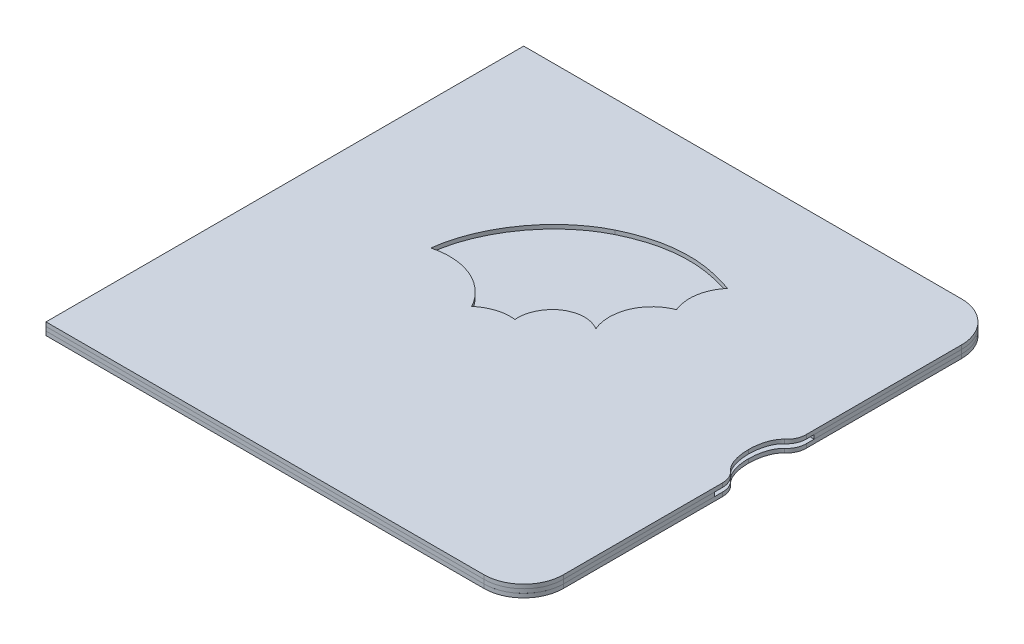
ISO-10303-21;
HEADER;
FILE_DESCRIPTION(('STEP AP214'),'2;1');
FILE_NAME('part.step','',(''),(''),'','','');
FILE_SCHEMA(('AUTOMOTIVE_DESIGN { 1 0 10303 214 1 1 1 1 }'));
ENDSEC;
DATA;
#1=APPLICATION_CONTEXT('core data for automotive mechanical design processes');
#2=APPLICATION_PROTOCOL_DEFINITION('international standard','automotive_design',2000,#1);
#3=PRODUCT_CONTEXT('',#1,'mechanical');
#4=PRODUCT('Part','Part','',(#3));
#5=PRODUCT_RELATED_PRODUCT_CATEGORY('part','',(#4));
#6=PRODUCT_DEFINITION_FORMATION('','',#4);
#7=PRODUCT_DEFINITION_CONTEXT('part definition',#1,'design');
#8=PRODUCT_DEFINITION('design','',#6,#7);
#9=PRODUCT_DEFINITION_SHAPE('','',#8);
#10=(LENGTH_UNIT() NAMED_UNIT(*) SI_UNIT(.MILLI.,.METRE.));
#11=(NAMED_UNIT(*) PLANE_ANGLE_UNIT() SI_UNIT($,.RADIAN.));
#12=(NAMED_UNIT(*) SI_UNIT($,.STERADIAN.) SOLID_ANGLE_UNIT());
#13=UNCERTAINTY_MEASURE_WITH_UNIT(LENGTH_MEASURE(1.E-05),#10,'distance_accuracy_value','');
#14=(GEOMETRIC_REPRESENTATION_CONTEXT(3) GLOBAL_UNCERTAINTY_ASSIGNED_CONTEXT((#13)) GLOBAL_UNIT_ASSIGNED_CONTEXT((#10,
#11,#12)) REPRESENTATION_CONTEXT('',''));
#15=CARTESIAN_POINT('',(0.,0.,0.));
#16=DIRECTION('',(0.,0.,1.));
#17=DIRECTION('',(1.,0.,0.));
#18=AXIS2_PLACEMENT_3D('',#15,#16,#17);
#19=CARTESIAN_POINT('',(-27.7753,3.,-4.1925));
#20=CARTESIAN_POINT('',(-26.4401,3.,-15.5149));
#21=CARTESIAN_POINT('',(-18.3845,3.,-26.4954));
#22=CARTESIAN_POINT('',(-8.5135,3.,-31.2762));
#23=B_SPLINE_CURVE_WITH_KNOTS('',3,(#19,#20,#21,#22),.UNSPECIFIED.,.F.,.F.,(4,4),
(0.961538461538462,1.),.UNSPECIFIED.);
#24=DIRECTION('',(0.,-1.,0.));
#25=VECTOR('',#24,1.);
#26=SURFACE_OF_LINEAR_EXTRUSION('',#23,#25);
#27=CARTESIAN_POINT('',(-27.7753,2.,-4.1925));
#28=CARTESIAN_POINT('',(-26.4401,2.,-15.5149));
#29=CARTESIAN_POINT('',(-18.3845,2.,-26.4954));
#30=CARTESIAN_POINT('',(-8.5135,2.,-31.2762));
#31=B_SPLINE_CURVE_WITH_KNOTS('',3,(#27,#28,#29,#30),.UNSPECIFIED.,.F.,.F.,(4,4),
(0.961538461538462,1.),.UNSPECIFIED.);
#32=CARTESIAN_POINT('',(-27.7753,2.,-4.1925));
#33=VERTEX_POINT('',#32);
#34=CARTESIAN_POINT('',(-8.5135,2.,-31.2762));
#35=VERTEX_POINT('',#34);
#36=EDGE_CURVE('E722',#33,#35,#31,.T.);
#37=ORIENTED_EDGE('',*,*,#36,.T.);
#38=DIRECTION('',(0.,-1.,0.));
#39=VECTOR('',#38,1.);
#40=CARTESIAN_POINT('',(-8.5135,3.,-31.2762));
#41=LINE('',#40,#39);
#42=CARTESIAN_POINT('',(-8.5135,3.,-31.2762));
#43=VERTEX_POINT('',#42);
#44=EDGE_CURVE('E12',#43,#35,#41,.T.);
#45=ORIENTED_EDGE('',*,*,#44,.F.);
#46=CARTESIAN_POINT('',(-27.7753,3.,-4.1925));
#47=VERTEX_POINT('',#46);
#48=EDGE_CURVE('E494',#47,#43,#23,.T.);
#49=ORIENTED_EDGE('',*,*,#48,.F.);
#50=DIRECTION('',(0.,-1.,0.));
#51=VECTOR('',#50,1.);
#52=CARTESIAN_POINT('',(-27.7753,3.,-4.1925));
#53=LINE('',#52,#51);
#54=EDGE_CURVE('E626',#47,#33,#53,.T.);
#55=ORIENTED_EDGE('',*,*,#54,.T.);
#56=EDGE_LOOP('',(#37,#45,#49,#55));
#57=FACE_BOUND('',#56,.T.);
#58=ADVANCED_FACE('F48',(#57),#26,.F.);
#59=CARTESIAN_POINT('',(-8.5135,3.,-31.2762));
#60=CARTESIAN_POINT('',(1.3575,3.,-36.057));
#61=CARTESIAN_POINT('',(9.8262,3.,-35.7255));
#62=CARTESIAN_POINT('',(18.2733,3.,-32.6785));
#63=B_SPLINE_CURVE_WITH_KNOTS('',3,(#59,#60,#61,#62),.UNSPECIFIED.,.F.,.F.,(4,4),(0.,
0.0384615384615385),.UNSPECIFIED.);
#64=DIRECTION('',(0.,-1.,0.));
#65=VECTOR('',#64,1.);
#66=SURFACE_OF_LINEAR_EXTRUSION('',#63,#65);
#67=CARTESIAN_POINT('',(-8.5135,2.,-31.2762));
#68=CARTESIAN_POINT('',(1.3575,2.,-36.057));
#69=CARTESIAN_POINT('',(9.8262,2.,-35.7255));
#70=CARTESIAN_POINT('',(18.2733,2.,-32.6785));
#71=B_SPLINE_CURVE_WITH_KNOTS('',3,(#67,#68,#69,#70),.UNSPECIFIED.,.F.,.F.,(4,4),(0.,
0.0384615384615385),.UNSPECIFIED.);
#72=CARTESIAN_POINT('',(18.2733,2.,-32.6785));
#73=VERTEX_POINT('',#72);
#74=EDGE_CURVE('E729',#35,#73,#71,.T.);
#75=ORIENTED_EDGE('',*,*,#74,.T.);
#76=DIRECTION('',(0.,-1.,0.));
#77=VECTOR('',#76,1.);
#78=CARTESIAN_POINT('',(18.2733,3.,-32.6785));
#79=LINE('',#78,#77);
#80=CARTESIAN_POINT('',(18.2733,3.,-32.6785));
#81=VERTEX_POINT('',#80);
#82=EDGE_CURVE('E58',#81,#73,#79,.T.);
#83=ORIENTED_EDGE('',*,*,#82,.F.);
#84=EDGE_CURVE('E490',#43,#81,#63,.T.);
#85=ORIENTED_EDGE('',*,*,#84,.F.);
#86=ORIENTED_EDGE('',*,*,#44,.T.);
#87=EDGE_LOOP('',(#75,#83,#85,#86));
#88=FACE_BOUND('',#87,.T.);
#89=ADVANCED_FACE('F483',(#88),#66,.F.);
#90=CARTESIAN_POINT('',(18.2733,3.,-32.6785));
#91=CARTESIAN_POINT('',(17.5449,3.,-31.8276));
#92=CARTESIAN_POINT('',(16.9472,3.,-30.8614));
#93=CARTESIAN_POINT('',(16.512,3.,-29.8109));
#94=B_SPLINE_CURVE_WITH_KNOTS('',3,(#90,#91,#92,#93),.UNSPECIFIED.,.F.,.F.,(4,4),
(0.0384615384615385,0.0769230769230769),.UNSPECIFIED.);
#95=DIRECTION('',(0.,-1.,0.));
#96=VECTOR('',#95,1.);
#97=SURFACE_OF_LINEAR_EXTRUSION('',#94,#96);
#98=CARTESIAN_POINT('',(18.2733,2.,-32.6785));
#99=CARTESIAN_POINT('',(17.5449,2.,-31.8276));
#100=CARTESIAN_POINT('',(16.9472,2.,-30.8614));
#101=CARTESIAN_POINT('',(16.512,2.,-29.8109));
#102=B_SPLINE_CURVE_WITH_KNOTS('',3,(#98,#99,#100,#101),.UNSPECIFIED.,.F.,.F.,(4,4),
(0.0384615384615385,0.0769230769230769),.UNSPECIFIED.);
#103=CARTESIAN_POINT('',(16.512,2.,-29.8109));
#104=VERTEX_POINT('',#103);
#105=EDGE_CURVE('E736',#73,#104,#102,.T.);
#106=ORIENTED_EDGE('',*,*,#105,.T.);
#107=DIRECTION('',(0.,-1.,0.));
#108=VECTOR('',#107,1.);
#109=CARTESIAN_POINT('',(16.512,3.,-29.8109));
#110=LINE('',#109,#108);
#111=CARTESIAN_POINT('',(16.512,3.,-29.8109));
#112=VERTEX_POINT('',#111);
#113=EDGE_CURVE('E683',#112,#104,#110,.T.);
#114=ORIENTED_EDGE('',*,*,#113,.F.);
#115=EDGE_CURVE('E468',#81,#112,#94,.T.);
#116=ORIENTED_EDGE('',*,*,#115,.F.);
#117=ORIENTED_EDGE('',*,*,#82,.T.);
#118=EDGE_LOOP('',(#106,#114,#116,#117));
#119=FACE_BOUND('',#118,.T.);
#120=ADVANCED_FACE('F479',(#119),#97,.F.);
#121=CARTESIAN_POINT('',(16.512,3.,-29.8109));
#122=CARTESIAN_POINT('',(16.0966,3.,-28.8087));
#123=CARTESIAN_POINT('',(15.8284,3.,-27.73));
#124=CARTESIAN_POINT('',(15.7357,3.,-26.6016));
#125=B_SPLINE_CURVE_WITH_KNOTS('',3,(#121,#122,#123,#124),.UNSPECIFIED.,.F.,.F.,(4,4),
(0.0769230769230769,0.115384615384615),.UNSPECIFIED.);
#126=DIRECTION('',(0.,-1.,0.));
#127=VECTOR('',#126,1.);
#128=SURFACE_OF_LINEAR_EXTRUSION('',#125,#127);
#129=CARTESIAN_POINT('',(16.512,2.,-29.8109));
#130=CARTESIAN_POINT('',(16.0966,2.,-28.8087));
#131=CARTESIAN_POINT('',(15.8284,2.,-27.73));
#132=CARTESIAN_POINT('',(15.7357,2.,-26.6016));
#133=B_SPLINE_CURVE_WITH_KNOTS('',3,(#129,#130,#131,#132),.UNSPECIFIED.,.F.,.F.,(4,4),
(0.0769230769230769,0.115384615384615),.UNSPECIFIED.);
#134=CARTESIAN_POINT('',(15.7357,2.,-26.6016));
#135=VERTEX_POINT('',#134);
#136=EDGE_CURVE('E743',#104,#135,#133,.T.);
#137=ORIENTED_EDGE('',*,*,#136,.T.);
#138=DIRECTION('',(0.,-1.,0.));
#139=VECTOR('',#138,1.);
#140=CARTESIAN_POINT('',(15.7357,3.,-26.6016));
#141=LINE('',#140,#139);
#142=CARTESIAN_POINT('',(15.7357,3.,-26.6016));
#143=VERTEX_POINT('',#142);
#144=EDGE_CURVE('E680',#143,#135,#141,.T.);
#145=ORIENTED_EDGE('',*,*,#144,.F.);
#146=EDGE_CURVE('E460',#112,#143,#125,.T.);
#147=ORIENTED_EDGE('',*,*,#146,.F.);
#148=ORIENTED_EDGE('',*,*,#113,.T.);
#149=EDGE_LOOP('',(#137,#145,#147,#148));
#150=FACE_BOUND('',#149,.T.);
#151=ADVANCED_FACE('F476',(#150),#128,.F.);
#152=CARTESIAN_POINT('',(15.7357,3.,-26.6016));
#153=CARTESIAN_POINT('',(15.7113,3.,-26.3067));
#154=CARTESIAN_POINT('',(15.6983,3.,-26.3323));
#155=CARTESIAN_POINT('',(15.6983,3.,-25.0825));
#156=CARTESIAN_POINT('',(15.8217,3.,-23.839));
#157=CARTESIAN_POINT('',(16.053,3.,-22.9631));
#158=B_SPLINE_CURVE_WITH_KNOTS('',3,(#152,#153,#154,#155,#156,#157),.UNSPECIFIED.,.F.,.F.,(4,2,
4),(0.115384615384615,0.153846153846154,0.192307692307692),.UNSPECIFIED.);
#159=DIRECTION('',(0.,-1.,0.));
#160=VECTOR('',#159,1.);
#161=SURFACE_OF_LINEAR_EXTRUSION('',#158,#160);
#162=CARTESIAN_POINT('',(15.7357,2.,-26.6016));
#163=CARTESIAN_POINT('',(15.7113,2.,-26.3067));
#164=CARTESIAN_POINT('',(15.6983,2.,-26.3323));
#165=CARTESIAN_POINT('',(15.6983,2.,-25.0825));
#166=CARTESIAN_POINT('',(15.8217,2.,-23.839));
#167=CARTESIAN_POINT('',(16.053,2.,-22.9631));
#168=B_SPLINE_CURVE_WITH_KNOTS('',3,(#162,#163,#164,#165,#166,#167),.UNSPECIFIED.,.F.,.F.,(4,2,
4),(0.115384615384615,0.153846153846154,0.192307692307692),.UNSPECIFIED.);
#169=CARTESIAN_POINT('',(16.053,2.,-22.9631));
#170=VERTEX_POINT('',#169);
#171=EDGE_CURVE('E750',#135,#170,#168,.T.);
#172=ORIENTED_EDGE('',*,*,#171,.T.);
#173=DIRECTION('',(0.,-1.,0.));
#174=VECTOR('',#173,1.);
#175=CARTESIAN_POINT('',(16.053,3.,-22.9631));
#176=LINE('',#175,#174);
#177=CARTESIAN_POINT('',(16.053,3.,-22.9631));
#178=VERTEX_POINT('',#177);
#179=EDGE_CURVE('E677',#178,#170,#176,.T.);
#180=ORIENTED_EDGE('',*,*,#179,.F.);
#181=EDGE_CURVE('E452',#143,#178,#158,.T.);
#182=ORIENTED_EDGE('',*,*,#181,.F.);
#183=ORIENTED_EDGE('',*,*,#144,.T.);
#184=EDGE_LOOP('',(#172,#180,#182,#183));
#185=FACE_BOUND('',#184,.T.);
#186=ADVANCED_FACE('F444',(#185),#161,.F.);
#187=CARTESIAN_POINT('',(16.053,3.,-22.9631));
#188=CARTESIAN_POINT('',(16.1724,3.,-22.5112));
#189=CARTESIAN_POINT('',(16.3205,3.,-22.0709));
#190=CARTESIAN_POINT('',(16.4952,3.,-21.6444));
#191=B_SPLINE_CURVE_WITH_KNOTS('',3,(#187,#188,#189,#190),.UNSPECIFIED.,.F.,.F.,(4,4),
(0.192307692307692,0.230769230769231),.UNSPECIFIED.);
#192=DIRECTION('',(0.,-1.,0.));
#193=VECTOR('',#192,1.);
#194=SURFACE_OF_LINEAR_EXTRUSION('',#191,#193);
#195=CARTESIAN_POINT('',(16.053,2.,-22.9631));
#196=CARTESIAN_POINT('',(16.1724,2.,-22.5112));
#197=CARTESIAN_POINT('',(16.3205,2.,-22.0709));
#198=CARTESIAN_POINT('',(16.4952,2.,-21.6444));
#199=B_SPLINE_CURVE_WITH_KNOTS('',3,(#195,#196,#197,#198),.UNSPECIFIED.,.F.,.F.,(4,4),
(0.192307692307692,0.230769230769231),.UNSPECIFIED.);
#200=CARTESIAN_POINT('',(16.4952,2.,-21.6444));
#201=VERTEX_POINT('',#200);
#202=EDGE_CURVE('E757',#170,#201,#199,.T.);
#203=ORIENTED_EDGE('',*,*,#202,.T.);
#204=DIRECTION('',(0.,-1.,0.));
#205=VECTOR('',#204,1.);
#206=CARTESIAN_POINT('',(16.4952,3.,-21.6444));
#207=LINE('',#206,#205);
#208=CARTESIAN_POINT('',(16.4952,3.,-21.6444));
#209=VERTEX_POINT('',#208);
#210=EDGE_CURVE('E674',#209,#201,#207,.T.);
#211=ORIENTED_EDGE('',*,*,#210,.F.);
#212=EDGE_CURVE('E448',#178,#209,#191,.T.);
#213=ORIENTED_EDGE('',*,*,#212,.F.);
#214=ORIENTED_EDGE('',*,*,#179,.T.);
#215=EDGE_LOOP('',(#203,#211,#213,#214));
#216=FACE_BOUND('',#215,.T.);
#217=ADVANCED_FACE('F440',(#216),#194,.F.);
#218=CARTESIAN_POINT('',(16.4952,3.,-21.6444));
#219=CARTESIAN_POINT('',(15.5881,3.,-21.2925));
#220=CARTESIAN_POINT('',(14.7407,3.,-20.8208));
#221=CARTESIAN_POINT('',(13.9728,3.,-20.2484));
#222=B_SPLINE_CURVE_WITH_KNOTS('',3,(#218,#219,#220,#221),.UNSPECIFIED.,.F.,.F.,(4,4),
(0.230769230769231,0.269230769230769),.UNSPECIFIED.);
#223=DIRECTION('',(0.,-1.,0.));
#224=VECTOR('',#223,1.);
#225=SURFACE_OF_LINEAR_EXTRUSION('',#222,#224);
#226=CARTESIAN_POINT('',(16.4952,2.,-21.6444));
#227=CARTESIAN_POINT('',(15.5881,2.,-21.2925));
#228=CARTESIAN_POINT('',(14.7407,2.,-20.8208));
#229=CARTESIAN_POINT('',(13.9728,2.,-20.2484));
#230=B_SPLINE_CURVE_WITH_KNOTS('',3,(#226,#227,#228,#229),.UNSPECIFIED.,.F.,.F.,(4,4),
(0.230769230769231,0.269230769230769),.UNSPECIFIED.);
#231=CARTESIAN_POINT('',(13.9728,2.,-20.2484));
#232=VERTEX_POINT('',#231);
#233=EDGE_CURVE('E764',#201,#232,#230,.T.);
#234=ORIENTED_EDGE('',*,*,#233,.T.);
#235=DIRECTION('',(0.,-1.,0.));
#236=VECTOR('',#235,1.);
#237=CARTESIAN_POINT('',(13.9728,3.,-20.2484));
#238=LINE('',#237,#236);
#239=CARTESIAN_POINT('',(13.9728,3.,-20.2484));
#240=VERTEX_POINT('',#239);
#241=EDGE_CURVE('E671',#240,#232,#238,.T.);
#242=ORIENTED_EDGE('',*,*,#241,.F.);
#243=EDGE_CURVE('E425',#209,#240,#222,.T.);
#244=ORIENTED_EDGE('',*,*,#243,.F.);
#245=ORIENTED_EDGE('',*,*,#210,.T.);
#246=EDGE_LOOP('',(#234,#242,#244,#245));
#247=FACE_BOUND('',#246,.T.);
#248=ADVANCED_FACE('F436',(#247),#225,.F.);
#249=CARTESIAN_POINT('',(13.9728,3.,-20.2484));
#250=CARTESIAN_POINT('',(12.9936,3.,-19.5191));
#251=CARTESIAN_POINT('',(12.143,3.,-18.6267));
#252=CARTESIAN_POINT('',(11.4613,3.,-17.6115));
#253=B_SPLINE_CURVE_WITH_KNOTS('',3,(#249,#250,#251,#252),.UNSPECIFIED.,.F.,.F.,(4,4),
(0.269230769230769,0.307692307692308),.UNSPECIFIED.);
#254=DIRECTION('',(0.,-1.,0.));
#255=VECTOR('',#254,1.);
#256=SURFACE_OF_LINEAR_EXTRUSION('',#253,#255);
#257=CARTESIAN_POINT('',(13.9728,2.,-20.2484));
#258=CARTESIAN_POINT('',(12.9936,2.,-19.5191));
#259=CARTESIAN_POINT('',(12.143,2.,-18.6267));
#260=CARTESIAN_POINT('',(11.4613,2.,-17.6115));
#261=B_SPLINE_CURVE_WITH_KNOTS('',3,(#257,#258,#259,#260),.UNSPECIFIED.,.F.,.F.,(4,4),
(0.269230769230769,0.307692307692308),.UNSPECIFIED.);
#262=CARTESIAN_POINT('',(11.4613,2.,-17.6115));
#263=VERTEX_POINT('',#262);
#264=EDGE_CURVE('E771',#232,#263,#261,.T.);
#265=ORIENTED_EDGE('',*,*,#264,.T.);
#266=DIRECTION('',(0.,-1.,0.));
#267=VECTOR('',#266,1.);
#268=CARTESIAN_POINT('',(11.4613,3.,-17.6115));
#269=LINE('',#268,#267);
#270=CARTESIAN_POINT('',(11.4613,3.,-17.6115));
#271=VERTEX_POINT('',#270);
#272=EDGE_CURVE('E668',#271,#263,#269,.T.);
#273=ORIENTED_EDGE('',*,*,#272,.F.);
#274=EDGE_CURVE('E417',#240,#271,#253,.T.);
#275=ORIENTED_EDGE('',*,*,#274,.F.);
#276=ORIENTED_EDGE('',*,*,#241,.T.);
#277=EDGE_LOOP('',(#265,#273,#275,#276));
#278=FACE_BOUND('',#277,.T.);
#279=ADVANCED_FACE('F433',(#278),#256,.F.);
#280=CARTESIAN_POINT('',(11.4613,3.,-17.6115));
#281=CARTESIAN_POINT('',(10.8441,3.,-16.6923));
#282=CARTESIAN_POINT('',(10.3655,3.,-15.6723));
#283=CARTESIAN_POINT('',(10.0555,3.,-14.5814));
#284=B_SPLINE_CURVE_WITH_KNOTS('',3,(#280,#281,#282,#283),.UNSPECIFIED.,.F.,.F.,(4,4),
(0.307692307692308,0.346153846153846),.UNSPECIFIED.);
#285=DIRECTION('',(0.,-1.,0.));
#286=VECTOR('',#285,1.);
#287=SURFACE_OF_LINEAR_EXTRUSION('',#284,#286);
#288=CARTESIAN_POINT('',(11.4613,2.,-17.6115));
#289=CARTESIAN_POINT('',(10.8441,2.,-16.6923));
#290=CARTESIAN_POINT('',(10.3655,2.,-15.6723));
#291=CARTESIAN_POINT('',(10.0555,2.,-14.5814));
#292=B_SPLINE_CURVE_WITH_KNOTS('',3,(#288,#289,#290,#291),.UNSPECIFIED.,.F.,.F.,(4,4),
(0.307692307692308,0.346153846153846),.UNSPECIFIED.);
#293=CARTESIAN_POINT('',(10.0555,2.,-14.5814));
#294=VERTEX_POINT('',#293);
#295=EDGE_CURVE('E778',#263,#294,#292,.T.);
#296=ORIENTED_EDGE('',*,*,#295,.T.);
#297=DIRECTION('',(0.,-1.,0.));
#298=VECTOR('',#297,1.);
#299=CARTESIAN_POINT('',(10.0555,3.,-14.5814));
#300=LINE('',#299,#298);
#301=CARTESIAN_POINT('',(10.0555,3.,-14.5814));
#302=VERTEX_POINT('',#301);
#303=EDGE_CURVE('E665',#302,#294,#300,.T.);
#304=ORIENTED_EDGE('',*,*,#303,.F.);
#305=EDGE_CURVE('E409',#271,#302,#284,.T.);
#306=ORIENTED_EDGE('',*,*,#305,.F.);
#307=ORIENTED_EDGE('',*,*,#272,.T.);
#308=EDGE_LOOP('',(#296,#304,#306,#307));
#309=FACE_BOUND('',#308,.T.);
#310=ADVANCED_FACE('F401',(#309),#287,.F.);
#311=CARTESIAN_POINT('',(10.0555,3.,-14.5814));
#312=CARTESIAN_POINT('',(9.7899,3.,-13.6473));
#313=CARTESIAN_POINT('',(9.6473,3.,-12.211));
#314=CARTESIAN_POINT('',(9.6473,3.,-11.0734));
#315=CARTESIAN_POINT('',(9.6492,3.,-11.4058));
#316=CARTESIAN_POINT('',(9.6537,3.,-11.2883));
#317=B_SPLINE_CURVE_WITH_KNOTS('',3,(#311,#312,#313,#314,#315,#316),.UNSPECIFIED.,.F.,.F.,(4,2,
4),(0.346153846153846,0.384615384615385,0.423076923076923),.UNSPECIFIED.);
#318=DIRECTION('',(0.,-1.,0.));
#319=VECTOR('',#318,1.);
#320=SURFACE_OF_LINEAR_EXTRUSION('',#317,#319);
#321=CARTESIAN_POINT('',(10.0555,2.,-14.5814));
#322=CARTESIAN_POINT('',(9.7899,2.,-13.6473));
#323=CARTESIAN_POINT('',(9.6473,2.,-12.211));
#324=CARTESIAN_POINT('',(9.6473,2.,-11.0734));
#325=CARTESIAN_POINT('',(9.6492,2.,-11.4058));
#326=CARTESIAN_POINT('',(9.6537,2.,-11.2883));
#327=B_SPLINE_CURVE_WITH_KNOTS('',3,(#321,#322,#323,#324,#325,#326),.UNSPECIFIED.,.F.,.F.,(4,2,
4),(0.346153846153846,0.384615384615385,0.423076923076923),.UNSPECIFIED.);
#328=CARTESIAN_POINT('',(9.6537,2.,-11.2883));
#329=VERTEX_POINT('',#328);
#330=EDGE_CURVE('E785',#294,#329,#327,.T.);
#331=ORIENTED_EDGE('',*,*,#330,.T.);
#332=DIRECTION('',(0.,-1.,0.));
#333=VECTOR('',#332,1.);
#334=CARTESIAN_POINT('',(9.6537,3.,-11.2883));
#335=LINE('',#334,#333);
#336=CARTESIAN_POINT('',(9.6537,3.,-11.2883));
#337=VERTEX_POINT('',#336);
#338=EDGE_CURVE('E662',#337,#329,#335,.T.);
#339=ORIENTED_EDGE('',*,*,#338,.F.);
#340=EDGE_CURVE('E405',#302,#337,#317,.T.);
#341=ORIENTED_EDGE('',*,*,#340,.F.);
#342=ORIENTED_EDGE('',*,*,#303,.T.);
#343=EDGE_LOOP('',(#331,#339,#341,#342));
#344=FACE_BOUND('',#343,.T.);
#345=ADVANCED_FACE('F397',(#344),#320,.F.);
#346=CARTESIAN_POINT('',(9.6537,3.,-11.2883));
#347=CARTESIAN_POINT('',(9.6983,3.,-9.915));
#348=CARTESIAN_POINT('',(10.0009,3.,-8.607));
#349=CARTESIAN_POINT('',(10.5147,3.,-7.4112));
#350=B_SPLINE_CURVE_WITH_KNOTS('',3,(#346,#347,#348,#349),.UNSPECIFIED.,.F.,.F.,(4,4),
(0.423076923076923,0.461538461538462),.UNSPECIFIED.);
#351=DIRECTION('',(0.,-1.,0.));
#352=VECTOR('',#351,1.);
#353=SURFACE_OF_LINEAR_EXTRUSION('',#350,#352);
#354=CARTESIAN_POINT('',(9.6537,2.,-11.2883));
#355=CARTESIAN_POINT('',(9.6983,2.,-9.915));
#356=CARTESIAN_POINT('',(10.0009,2.,-8.607));
#357=CARTESIAN_POINT('',(10.5147,2.,-7.4112));
#358=B_SPLINE_CURVE_WITH_KNOTS('',3,(#354,#355,#356,#357),.UNSPECIFIED.,.F.,.F.,(4,4),
(0.423076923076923,0.461538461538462),.UNSPECIFIED.);
#359=CARTESIAN_POINT('',(10.5147,2.,-7.4112));
#360=VERTEX_POINT('',#359);
#361=EDGE_CURVE('E792',#329,#360,#358,.T.);
#362=ORIENTED_EDGE('',*,*,#361,.T.);
#363=DIRECTION('',(0.,-1.,0.));
#364=VECTOR('',#363,1.);
#365=CARTESIAN_POINT('',(10.5147,3.,-7.4112));
#366=LINE('',#365,#364);
#367=CARTESIAN_POINT('',(10.5147,3.,-7.4112));
#368=VERTEX_POINT('',#367);
#369=EDGE_CURVE('E659',#368,#360,#366,.T.);
#370=ORIENTED_EDGE('',*,*,#369,.F.);
#371=EDGE_CURVE('E382',#337,#368,#350,.T.);
#372=ORIENTED_EDGE('',*,*,#371,.F.);
#373=ORIENTED_EDGE('',*,*,#338,.T.);
#374=EDGE_LOOP('',(#362,#370,#372,#373));
#375=FACE_BOUND('',#374,.T.);
#376=ADVANCED_FACE('F393',(#375),#353,.F.);
#377=CARTESIAN_POINT('',(10.5147,3.,-7.4112));
#378=CARTESIAN_POINT('',(8.2537,3.,-8.6483));
#379=CARTESIAN_POINT('',(5.8201,3.,-8.9907));
#380=CARTESIAN_POINT('',(0.0847,3.,-6.2127));
#381=CARTESIAN_POINT('',(-2.0359,3.,-2.6243));
#382=CARTESIAN_POINT('',(-1.649,3.,0.7598));
#383=B_SPLINE_CURVE_WITH_KNOTS('',3,(#377,#378,#379,#380,#381,#382),.UNSPECIFIED.,.F.,.F.,(4,2,
4),(0.461538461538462,0.5,0.538461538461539),.UNSPECIFIED.);
#384=DIRECTION('',(0.,-1.,0.));
#385=VECTOR('',#384,1.);
#386=SURFACE_OF_LINEAR_EXTRUSION('',#383,#385);
#387=CARTESIAN_POINT('',(10.5147,2.,-7.4112));
#388=CARTESIAN_POINT('',(8.2537,2.,-8.6483));
#389=CARTESIAN_POINT('',(5.8201,2.,-8.9907));
#390=CARTESIAN_POINT('',(0.0847,2.,-6.2127));
#391=CARTESIAN_POINT('',(-2.0359,2.,-2.6243));
#392=CARTESIAN_POINT('',(-1.649,2.,0.7598));
#393=B_SPLINE_CURVE_WITH_KNOTS('',3,(#387,#388,#389,#390,#391,#392),.UNSPECIFIED.,.F.,.F.,(4,2,
4),(0.461538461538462,0.5,0.538461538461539),.UNSPECIFIED.);
#394=CARTESIAN_POINT('',(-1.649,2.,0.7598));
#395=VERTEX_POINT('',#394);
#396=EDGE_CURVE('E799',#360,#395,#393,.T.);
#397=ORIENTED_EDGE('',*,*,#396,.T.);
#398=DIRECTION('',(0.,-1.,0.));
#399=VECTOR('',#398,1.);
#400=CARTESIAN_POINT('',(-1.649,3.,0.7598));
#401=LINE('',#400,#399);
#402=CARTESIAN_POINT('',(-1.649,3.,0.7598));
#403=VERTEX_POINT('',#402);
#404=EDGE_CURVE('E656',#403,#395,#401,.T.);
#405=ORIENTED_EDGE('',*,*,#404,.F.);
#406=EDGE_CURVE('E374',#368,#403,#383,.T.);
#407=ORIENTED_EDGE('',*,*,#406,.F.);
#408=ORIENTED_EDGE('',*,*,#369,.T.);
#409=EDGE_LOOP('',(#397,#405,#407,#408));
#410=FACE_BOUND('',#409,.T.);
#411=ADVANCED_FACE('F390',(#410),#386,.F.);
#412=CARTESIAN_POINT('',(-1.649,3.,0.7598));
#413=CARTESIAN_POINT('',(-2.0365,3.,0.7174));
#414=CARTESIAN_POINT('',(-2.2678,3.,0.6949));
#415=CARTESIAN_POINT('',(-3.3898,3.,0.6949));
#416=CARTESIAN_POINT('',(-4.2584,3.,0.7665));
#417=CARTESIAN_POINT('',(-4.9414,3.,0.903));
#418=B_SPLINE_CURVE_WITH_KNOTS('',3,(#412,#413,#414,#415,#416,#417),.UNSPECIFIED.,.F.,.F.,(4,2,
4),(0.538461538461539,0.576923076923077,0.615384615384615),.UNSPECIFIED.);
#419=DIRECTION('',(0.,-1.,0.));
#420=VECTOR('',#419,1.);
#421=SURFACE_OF_LINEAR_EXTRUSION('',#418,#420);
#422=CARTESIAN_POINT('',(-1.649,2.,0.7598));
#423=CARTESIAN_POINT('',(-2.0365,2.,0.7174));
#424=CARTESIAN_POINT('',(-2.2678,2.,0.6949));
#425=CARTESIAN_POINT('',(-3.3898,2.,0.6949));
#426=CARTESIAN_POINT('',(-4.2584,2.,0.7665));
#427=CARTESIAN_POINT('',(-4.9414,2.,0.903));
#428=B_SPLINE_CURVE_WITH_KNOTS('',3,(#422,#423,#424,#425,#426,#427),.UNSPECIFIED.,.F.,.F.,(4,2,
4),(0.538461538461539,0.576923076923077,0.615384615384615),.UNSPECIFIED.);
#429=CARTESIAN_POINT('',(-4.9414,2.,0.903));
#430=VERTEX_POINT('',#429);
#431=EDGE_CURVE('E806',#395,#430,#428,.T.);
#432=ORIENTED_EDGE('',*,*,#431,.T.);
#433=DIRECTION('',(0.,-1.,0.));
#434=VECTOR('',#433,1.);
#435=CARTESIAN_POINT('',(-4.9414,3.,0.903));
#436=LINE('',#435,#434);
#437=CARTESIAN_POINT('',(-4.9414,3.,0.903));
#438=VERTEX_POINT('',#437);
#439=EDGE_CURVE('E653',#438,#430,#436,.T.);
#440=ORIENTED_EDGE('',*,*,#439,.F.);
#441=EDGE_CURVE('E366',#403,#438,#418,.T.);
#442=ORIENTED_EDGE('',*,*,#441,.F.);
#443=ORIENTED_EDGE('',*,*,#404,.T.);
#444=EDGE_LOOP('',(#432,#440,#442,#443));
#445=FACE_BOUND('',#444,.T.);
#446=ADVANCED_FACE('F358',(#445),#421,.F.);
#447=CARTESIAN_POINT('',(-4.9414,3.,0.903));
#448=CARTESIAN_POINT('',(-6.0706,3.,1.1287));
#449=CARTESIAN_POINT('',(-7.1357,3.,1.5318));
#450=CARTESIAN_POINT('',(-8.1066,3.,2.0819));
#451=B_SPLINE_CURVE_WITH_KNOTS('',3,(#447,#448,#449,#450),.UNSPECIFIED.,.F.,.F.,(4,4),
(0.615384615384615,0.653846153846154),.UNSPECIFIED.);
#452=DIRECTION('',(0.,-1.,0.));
#453=VECTOR('',#452,1.);
#454=SURFACE_OF_LINEAR_EXTRUSION('',#451,#453);
#455=CARTESIAN_POINT('',(-4.9414,2.,0.903));
#456=CARTESIAN_POINT('',(-6.0706,2.,1.1287));
#457=CARTESIAN_POINT('',(-7.1357,2.,1.5318));
#458=CARTESIAN_POINT('',(-8.1066,2.,2.0819));
#459=B_SPLINE_CURVE_WITH_KNOTS('',3,(#455,#456,#457,#458),.UNSPECIFIED.,.F.,.F.,(4,4),
(0.615384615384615,0.653846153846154),.UNSPECIFIED.);
#460=CARTESIAN_POINT('',(-8.1066,2.,2.0819));
#461=VERTEX_POINT('',#460);
#462=EDGE_CURVE('E813',#430,#461,#459,.T.);
#463=ORIENTED_EDGE('',*,*,#462,.T.);
#464=DIRECTION('',(0.,-1.,0.));
#465=VECTOR('',#464,1.);
#466=CARTESIAN_POINT('',(-8.1066,3.,2.0819));
#467=LINE('',#466,#465);
#468=CARTESIAN_POINT('',(-8.1066,3.,2.0819));
#469=VERTEX_POINT('',#468);
#470=EDGE_CURVE('E650',#469,#461,#467,.T.);
#471=ORIENTED_EDGE('',*,*,#470,.F.);
#472=EDGE_CURVE('E362',#438,#469,#451,.T.);
#473=ORIENTED_EDGE('',*,*,#472,.F.);
#474=ORIENTED_EDGE('',*,*,#439,.T.);
#475=EDGE_LOOP('',(#463,#471,#473,#474));
#476=FACE_BOUND('',#475,.T.);
#477=ADVANCED_FACE('F354',(#476),#454,.F.);
#478=CARTESIAN_POINT('',(-8.1066,3.,2.0819));
#479=CARTESIAN_POINT('',(-8.7599,3.,2.452));
#480=CARTESIAN_POINT('',(-9.3705,3.,2.8887));
#481=CARTESIAN_POINT('',(-9.9293,3.,3.3827));
#482=B_SPLINE_CURVE_WITH_KNOTS('',3,(#478,#479,#480,#481),.UNSPECIFIED.,.F.,.F.,(4,4),
(0.653846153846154,0.692307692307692),.UNSPECIFIED.);
#483=DIRECTION('',(0.,-1.,0.));
#484=VECTOR('',#483,1.);
#485=SURFACE_OF_LINEAR_EXTRUSION('',#482,#484);
#486=CARTESIAN_POINT('',(-8.1066,2.,2.0819));
#487=CARTESIAN_POINT('',(-8.7599,2.,2.452));
#488=CARTESIAN_POINT('',(-9.3705,2.,2.8887));
#489=CARTESIAN_POINT('',(-9.9293,2.,3.3827));
#490=B_SPLINE_CURVE_WITH_KNOTS('',3,(#486,#487,#488,#489),.UNSPECIFIED.,.F.,.F.,(4,4),
(0.653846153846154,0.692307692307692),.UNSPECIFIED.);
#491=CARTESIAN_POINT('',(-9.9293,2.,3.3827));
#492=VERTEX_POINT('',#491);
#493=EDGE_CURVE('E820',#461,#492,#490,.T.);
#494=ORIENTED_EDGE('',*,*,#493,.T.);
#495=DIRECTION('',(0.,-1.,0.));
#496=VECTOR('',#495,1.);
#497=CARTESIAN_POINT('',(-9.9293,3.,3.3827));
#498=LINE('',#497,#496);
#499=CARTESIAN_POINT('',(-9.9293,3.,3.3827));
#500=VERTEX_POINT('',#499);
#501=EDGE_CURVE('E647',#500,#492,#498,.T.);
#502=ORIENTED_EDGE('',*,*,#501,.F.);
#503=EDGE_CURVE('E339',#469,#500,#482,.T.);
#504=ORIENTED_EDGE('',*,*,#503,.F.);
#505=ORIENTED_EDGE('',*,*,#470,.T.);
#506=EDGE_LOOP('',(#494,#502,#504,#505));
#507=FACE_BOUND('',#506,.T.);
#508=ADVANCED_FACE('F350',(#507),#485,.F.);
#509=CARTESIAN_POINT('',(-9.9293,3.,3.3827));
#510=CARTESIAN_POINT('',(-10.3896,3.,2.5343));
#511=CARTESIAN_POINT('',(-10.9267,3.,1.7338));
#512=CARTESIAN_POINT('',(-11.5309,3.,0.9899));
#513=B_SPLINE_CURVE_WITH_KNOTS('',3,(#509,#510,#511,#512),.UNSPECIFIED.,.F.,.F.,(4,4),
(0.692307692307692,0.730769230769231),.UNSPECIFIED.);
#514=DIRECTION('',(0.,-1.,0.));
#515=VECTOR('',#514,1.);
#516=SURFACE_OF_LINEAR_EXTRUSION('',#513,#515);
#517=CARTESIAN_POINT('',(-9.9293,2.,3.3827));
#518=CARTESIAN_POINT('',(-10.3896,2.,2.5343));
#519=CARTESIAN_POINT('',(-10.9267,2.,1.7338));
#520=CARTESIAN_POINT('',(-11.5309,2.,0.9899));
#521=B_SPLINE_CURVE_WITH_KNOTS('',3,(#517,#518,#519,#520),.UNSPECIFIED.,.F.,.F.,(4,4),
(0.692307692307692,0.730769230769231),.UNSPECIFIED.);
#522=CARTESIAN_POINT('',(-11.5309,2.,0.9899));
#523=VERTEX_POINT('',#522);
#524=EDGE_CURVE('E827',#492,#523,#521,.T.);
#525=ORIENTED_EDGE('',*,*,#524,.T.);
#526=DIRECTION('',(0.,-1.,0.));
#527=VECTOR('',#526,1.);
#528=CARTESIAN_POINT('',(-11.5309,3.,0.9899));
#529=LINE('',#528,#527);
#530=CARTESIAN_POINT('',(-11.5309,3.,0.9899));
#531=VERTEX_POINT('',#530);
#532=EDGE_CURVE('E644',#531,#523,#529,.T.);
#533=ORIENTED_EDGE('',*,*,#532,.F.);
#534=EDGE_CURVE('E331',#500,#531,#513,.T.);
#535=ORIENTED_EDGE('',*,*,#534,.F.);
#536=ORIENTED_EDGE('',*,*,#501,.T.);
#537=EDGE_LOOP('',(#525,#533,#535,#536));
#538=FACE_BOUND('',#537,.T.);
#539=ADVANCED_FACE('F347',(#538),#516,.F.);
#540=CARTESIAN_POINT('',(-11.5309,3.,0.9899));
#541=CARTESIAN_POINT('',(-12.4635,3.,-0.1577));
#542=CARTESIAN_POINT('',(-13.5566,3.,-1.1698));
#543=CARTESIAN_POINT('',(-14.7757,3.,-2.0126));
#544=B_SPLINE_CURVE_WITH_KNOTS('',3,(#540,#541,#542,#543),.UNSPECIFIED.,.F.,.F.,(4,4),
(0.730769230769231,0.769230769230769),.UNSPECIFIED.);
#545=DIRECTION('',(0.,-1.,0.));
#546=VECTOR('',#545,1.);
#547=SURFACE_OF_LINEAR_EXTRUSION('',#544,#546);
#548=CARTESIAN_POINT('',(-11.5309,2.,0.9899));
#549=CARTESIAN_POINT('',(-12.4635,2.,-0.1577));
#550=CARTESIAN_POINT('',(-13.5566,2.,-1.1698));
#551=CARTESIAN_POINT('',(-14.7757,2.,-2.0126));
#552=B_SPLINE_CURVE_WITH_KNOTS('',3,(#548,#549,#550,#551),.UNSPECIFIED.,.F.,.F.,(4,4),
(0.730769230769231,0.769230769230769),.UNSPECIFIED.);
#553=CARTESIAN_POINT('',(-14.7757,2.,-2.0126));
#554=VERTEX_POINT('',#553);
#555=EDGE_CURVE('E834',#523,#554,#552,.T.);
#556=ORIENTED_EDGE('',*,*,#555,.T.);
#557=DIRECTION('',(0.,-1.,0.));
#558=VECTOR('',#557,1.);
#559=CARTESIAN_POINT('',(-14.7757,3.,-2.0126));
#560=LINE('',#559,#558);
#561=CARTESIAN_POINT('',(-14.7757,3.,-2.0126));
#562=VERTEX_POINT('',#561);
#563=EDGE_CURVE('E641',#562,#554,#560,.T.);
#564=ORIENTED_EDGE('',*,*,#563,.F.);
#565=EDGE_CURVE('E323',#531,#562,#544,.T.);
#566=ORIENTED_EDGE('',*,*,#565,.F.);
#567=ORIENTED_EDGE('',*,*,#532,.T.);
#568=EDGE_LOOP('',(#556,#564,#566,#567));
#569=FACE_BOUND('',#568,.T.);
#570=ADVANCED_FACE('F316',(#569),#547,.F.);
#571=CARTESIAN_POINT('',(-14.7757,3.,-2.0126));
#572=CARTESIAN_POINT('',(-15.7417,3.,-2.68));
#573=CARTESIAN_POINT('',(-16.787,3.,-3.2409));
#574=CARTESIAN_POINT('',(-17.8945,3.,-3.6783));
#575=B_SPLINE_CURVE_WITH_KNOTS('',3,(#571,#572,#573,#574),.UNSPECIFIED.,.F.,.F.,(4,4),
(0.769230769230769,0.807692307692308),.UNSPECIFIED.);
#576=DIRECTION('',(0.,-1.,0.));
#577=VECTOR('',#576,1.);
#578=SURFACE_OF_LINEAR_EXTRUSION('',#575,#577);
#579=CARTESIAN_POINT('',(-14.7757,2.,-2.0126));
#580=CARTESIAN_POINT('',(-15.7417,2.,-2.68));
#581=CARTESIAN_POINT('',(-16.787,2.,-3.2409));
#582=CARTESIAN_POINT('',(-17.8945,2.,-3.6783));
#583=B_SPLINE_CURVE_WITH_KNOTS('',3,(#579,#580,#581,#582),.UNSPECIFIED.,.F.,.F.,(4,4),
(0.769230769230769,0.807692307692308),.UNSPECIFIED.);
#584=CARTESIAN_POINT('',(-17.8945,2.,-3.6783));
#585=VERTEX_POINT('',#584);
#586=EDGE_CURVE('E841',#554,#585,#583,.T.);
#587=ORIENTED_EDGE('',*,*,#586,.T.);
#588=DIRECTION('',(0.,-1.,0.));
#589=VECTOR('',#588,1.);
#590=CARTESIAN_POINT('',(-17.8945,3.,-3.6783));
#591=LINE('',#590,#589);
#592=CARTESIAN_POINT('',(-17.8945,3.,-3.6783));
#593=VERTEX_POINT('',#592);
#594=EDGE_CURVE('E284',#593,#585,#591,.T.);
#595=ORIENTED_EDGE('',*,*,#594,.F.);
#596=EDGE_CURVE('E275',#562,#593,#575,.T.);
#597=ORIENTED_EDGE('',*,*,#596,.F.);
#598=ORIENTED_EDGE('',*,*,#563,.T.);
#599=EDGE_LOOP('',(#587,#595,#597,#598));
#600=FACE_BOUND('',#599,.T.);
#601=ADVANCED_FACE('F313',(#600),#578,.F.);
#602=CARTESIAN_POINT('',(-17.8945,3.,-3.6783));
#603=CARTESIAN_POINT('',(-18.9104,3.,-4.0795));
#604=CARTESIAN_POINT('',(-19.9788,3.,-4.3767));
#605=CARTESIAN_POINT('',(-21.0863,3.,-4.5573));
#606=B_SPLINE_CURVE_WITH_KNOTS('',3,(#602,#603,#604,#605),.UNSPECIFIED.,.F.,.F.,(4,4),
(0.807692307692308,0.846153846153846),.UNSPECIFIED.);
#607=DIRECTION('',(0.,-1.,0.));
#608=VECTOR('',#607,1.);
#609=SURFACE_OF_LINEAR_EXTRUSION('',#606,#608);
#610=CARTESIAN_POINT('',(-17.8945,2.,-3.6783));
#611=CARTESIAN_POINT('',(-18.9104,2.,-4.0795));
#612=CARTESIAN_POINT('',(-19.9788,2.,-4.3767));
#613=CARTESIAN_POINT('',(-21.0863,2.,-4.5573));
#614=B_SPLINE_CURVE_WITH_KNOTS('',3,(#610,#611,#612,#613),.UNSPECIFIED.,.F.,.F.,(4,4),
(0.807692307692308,0.846153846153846),.UNSPECIFIED.);
#615=CARTESIAN_POINT('',(-21.0863,2.,-4.5573));
#616=VERTEX_POINT('',#615);
#617=EDGE_CURVE('E283',#585,#616,#614,.T.);
#618=ORIENTED_EDGE('',*,*,#617,.T.);
#619=DIRECTION('',(0.,-1.,0.));
#620=VECTOR('',#619,1.);
#621=CARTESIAN_POINT('',(-21.0863,3.,-4.5573));
#622=LINE('',#621,#620);
#623=CARTESIAN_POINT('',(-21.0863,3.,-4.5573));
#624=VERTEX_POINT('',#623);
#625=EDGE_CURVE('E280',#624,#616,#622,.T.);
#626=ORIENTED_EDGE('',*,*,#625,.F.);
#627=EDGE_CURVE('E269',#593,#624,#606,.T.);
#628=ORIENTED_EDGE('',*,*,#627,.F.);
#629=ORIENTED_EDGE('',*,*,#594,.T.);
#630=EDGE_LOOP('',(#618,#626,#628,#629));
#631=FACE_BOUND('',#630,.T.);
#632=ADVANCED_FACE('F281',(#631),#609,.F.);
#633=CARTESIAN_POINT('',(-21.0863,3.,-4.5573));
#634=CARTESIAN_POINT('',(-21.905,3.,-4.6905));
#635=CARTESIAN_POINT('',(-23.0421,3.,-4.7598));
#636=CARTESIAN_POINT('',(-24.1611,3.,-4.7598));
#637=CARTESIAN_POINT('',(-24.1251,3.,-4.7525));
#638=CARTESIAN_POINT('',(-24.3845,3.,-4.7404));
#639=B_SPLINE_CURVE_WITH_KNOTS('',3,(#633,#634,#635,#636,#637,#638),.UNSPECIFIED.,.F.,.F.,(4,2,
4),(0.846153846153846,0.884615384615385,0.923076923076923),.UNSPECIFIED.);
#640=DIRECTION('',(0.,-1.,0.));
#641=VECTOR('',#640,1.);
#642=SURFACE_OF_LINEAR_EXTRUSION('',#639,#641);
#643=CARTESIAN_POINT('',(-21.0863,2.,-4.5573));
#644=CARTESIAN_POINT('',(-21.905,2.,-4.6905));
#645=CARTESIAN_POINT('',(-23.0421,2.,-4.7598));
#646=CARTESIAN_POINT('',(-24.1611,2.,-4.7598));
#647=CARTESIAN_POINT('',(-24.1251,2.,-4.7525));
#648=CARTESIAN_POINT('',(-24.3845,2.,-4.7404));
#649=B_SPLINE_CURVE_WITH_KNOTS('',3,(#643,#644,#645,#646,#647,#648),.UNSPECIFIED.,.F.,.F.,(4,2,
4),(0.846153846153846,0.884615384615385,0.923076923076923),.UNSPECIFIED.);
#650=CARTESIAN_POINT('',(-24.3845,2.,-4.7404));
#651=VERTEX_POINT('',#650);
#652=EDGE_CURVE('E168',#616,#651,#649,.T.);
#653=ORIENTED_EDGE('',*,*,#652,.T.);
#654=DIRECTION('',(0.,-1.,0.));
#655=VECTOR('',#654,1.);
#656=CARTESIAN_POINT('',(-24.3845,3.,-4.7404));
#657=LINE('',#656,#655);
#658=CARTESIAN_POINT('',(-24.3845,3.,-4.7404));
#659=VERTEX_POINT('',#658);
#660=EDGE_CURVE('E285',#659,#651,#657,.T.);
#661=ORIENTED_EDGE('',*,*,#660,.F.);
#662=EDGE_CURVE('E273',#624,#659,#639,.T.);
#663=ORIENTED_EDGE('',*,*,#662,.F.);
#664=ORIENTED_EDGE('',*,*,#625,.T.);
#665=EDGE_LOOP('',(#653,#661,#663,#664));
#666=FACE_BOUND('',#665,.T.);
#667=ADVANCED_FACE('F287',(#666),#642,.F.);
#668=CARTESIAN_POINT('',(0.,3.,-59.8042));
#669=DIRECTION('',(0.,0.,1.));
#670=DIRECTION('',(1.,0.,0.));
#671=AXIS2_PLACEMENT_3D('',#668,#669,#670);
#672=PLANE('',#671);
#673=DIRECTION('',(-1.,0.,0.));
#674=VECTOR('',#673,1.);
#675=CARTESIAN_POINT('',(0.,2.,-59.8042));
#676=LINE('',#675,#674);
#677=CARTESIAN_POINT('',(49.9604,2.,-59.8042));
#678=VERTEX_POINT('',#677);
#679=CARTESIAN_POINT('',(-60.0396,2.,-59.8042));
#680=VERTEX_POINT('',#679);
#681=EDGE_CURVE('E895',#678,#680,#676,.T.);
#682=ORIENTED_EDGE('',*,*,#681,.T.);
#683=DIRECTION('',(0.,-1.,0.));
#684=VECTOR('',#683,1.);
#685=CARTESIAN_POINT('',(-60.0396,3.,-59.8042));
#686=LINE('',#685,#684);
#687=CARTESIAN_POINT('',(-60.0396,3.,-59.8042));
#688=VERTEX_POINT('',#687);
#689=EDGE_CURVE('E52',#688,#680,#686,.T.);
#690=ORIENTED_EDGE('',*,*,#689,.F.);
#691=DIRECTION('',(-1.,0.,0.));
#692=VECTOR('',#691,1.);
#693=CARTESIAN_POINT('',(0.,3.,-59.8042));
#694=LINE('',#693,#692);
#695=CARTESIAN_POINT('',(49.9604,3.,-59.8042));
#696=VERTEX_POINT('',#695);
#697=EDGE_CURVE('E861',#696,#688,#694,.T.);
#698=ORIENTED_EDGE('',*,*,#697,.F.);
#699=DIRECTION('',(0.,-1.,0.));
#700=VECTOR('',#699,1.);
#701=CARTESIAN_POINT('',(49.9604,3.,-59.8042));
#702=LINE('',#701,#700);
#703=EDGE_CURVE('E289',#696,#678,#702,.T.);
#704=ORIENTED_EDGE('',*,*,#703,.T.);
#705=EDGE_LOOP('',(#682,#690,#698,#704));
#706=FACE_BOUND('',#705,.T.);
#707=ADVANCED_FACE('F50',(#706),#672,.F.);
#708=CARTESIAN_POINT('',(-60.0396,3.,0.));
#709=DIRECTION('',(1.,0.,0.));
#710=DIRECTION('',(0.,0.,-1.));
#711=AXIS2_PLACEMENT_3D('',#708,#709,#710);
#712=PLANE('',#711);
#713=DIRECTION('',(0.,0.,1.));
#714=VECTOR('',#713,1.);
#715=CARTESIAN_POINT('',(-60.0396,2.,0.));
#716=LINE('',#715,#714);
#717=CARTESIAN_POINT('',(-60.0396,2.,60.1958));
#718=VERTEX_POINT('',#717);
#719=EDGE_CURVE('E894',#680,#718,#716,.T.);
#720=ORIENTED_EDGE('',*,*,#719,.T.);
#721=DIRECTION('',(0.,-1.,0.));
#722=VECTOR('',#721,1.);
#723=CARTESIAN_POINT('',(-60.0396,3.,60.1958));
#724=LINE('',#723,#722);
#725=CARTESIAN_POINT('',(-60.0396,3.,60.1958));
#726=VERTEX_POINT('',#725);
#727=EDGE_CURVE('E621',#726,#718,#724,.T.);
#728=ORIENTED_EDGE('',*,*,#727,.F.);
#729=DIRECTION('',(0.,0.,1.));
#730=VECTOR('',#729,1.);
#731=CARTESIAN_POINT('',(-60.0396,3.,0.));
#732=LINE('',#731,#730);
#733=EDGE_CURVE('E183',#688,#726,#732,.T.);
#734=ORIENTED_EDGE('',*,*,#733,.F.);
#735=ORIENTED_EDGE('',*,*,#689,.T.);
#736=EDGE_LOOP('',(#720,#728,#734,#735));
#737=FACE_BOUND('',#736,.T.);
#738=ADVANCED_FACE('F898',(#737),#712,.F.);
#739=CARTESIAN_POINT('',(0.,3.,60.1958));
#740=DIRECTION('',(0.,0.,-1.));
#741=DIRECTION('',(-1.,0.,0.));
#742=AXIS2_PLACEMENT_3D('',#739,#740,#741);
#743=PLANE('',#742);
#744=DIRECTION('',(1.,0.,0.));
#745=VECTOR('',#744,1.);
#746=CARTESIAN_POINT('',(0.,2.,60.1958));
#747=LINE('',#746,#745);
#748=CARTESIAN_POINT('',(49.9604,2.,60.1958));
#749=VERTEX_POINT('',#748);
#750=EDGE_CURVE('E867',#718,#749,#747,.T.);
#751=ORIENTED_EDGE('',*,*,#750,.T.);
#752=DIRECTION('',(0.,-1.,0.));
#753=VECTOR('',#752,1.);
#754=CARTESIAN_POINT('',(49.9604,3.,60.1958));
#755=LINE('',#754,#753);
#756=CARTESIAN_POINT('',(49.9604,3.,60.1958));
#757=VERTEX_POINT('',#756);
#758=EDGE_CURVE('E619',#757,#749,#755,.T.);
#759=ORIENTED_EDGE('',*,*,#758,.F.);
#760=DIRECTION('',(1.,0.,0.));
#761=VECTOR('',#760,1.);
#762=CARTESIAN_POINT('',(0.,3.,60.1958));
#763=LINE('',#762,#761);
#764=EDGE_CURVE('E585',#726,#757,#763,.T.);
#765=ORIENTED_EDGE('',*,*,#764,.F.);
#766=ORIENTED_EDGE('',*,*,#727,.T.);
#767=EDGE_LOOP('',(#751,#759,#765,#766));
#768=FACE_BOUND('',#767,.T.);
#769=ADVANCED_FACE('F577',(#768),#743,.F.);
#770=CARTESIAN_POINT('',(49.9604,3.,60.1958));
#771=CARTESIAN_POINT('',(55.4678,3.,60.1958));
#772=CARTESIAN_POINT('',(59.9604,3.,55.7032));
#773=CARTESIAN_POINT('',(59.9604,3.,50.1958));
#774=B_SPLINE_CURVE_WITH_KNOTS('',3,(#770,#771,#772,#773),.UNSPECIFIED.,.F.,.F.,(4,4),
(0.769230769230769,0.846153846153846),.UNSPECIFIED.);
#775=DIRECTION('',(0.,-1.,0.));
#776=VECTOR('',#775,1.);
#777=SURFACE_OF_LINEAR_EXTRUSION('',#774,#776);
#778=CARTESIAN_POINT('',(49.9604,2.,60.1958));
#779=CARTESIAN_POINT('',(55.4678,2.,60.1958));
#780=CARTESIAN_POINT('',(59.9604,2.,55.7032));
#781=CARTESIAN_POINT('',(59.9604,2.,50.1958));
#782=B_SPLINE_CURVE_WITH_KNOTS('',3,(#778,#779,#780,#781),.UNSPECIFIED.,.F.,.F.,(4,4),
(0.769230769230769,0.846153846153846),.UNSPECIFIED.);
#783=CARTESIAN_POINT('',(59.9604,2.,50.1958));
#784=VERTEX_POINT('',#783);
#785=EDGE_CURVE('E869',#749,#784,#782,.T.);
#786=ORIENTED_EDGE('',*,*,#785,.T.);
#787=DIRECTION('',(0.,-1.,0.));
#788=VECTOR('',#787,1.);
#789=CARTESIAN_POINT('',(59.9604,3.,50.1958));
#790=LINE('',#789,#788);
#791=CARTESIAN_POINT('',(59.9604,3.,50.1958));
#792=VERTEX_POINT('',#791);
#793=EDGE_CURVE('E616',#792,#784,#790,.T.);
#794=ORIENTED_EDGE('',*,*,#793,.F.);
#795=EDGE_CURVE('E579',#757,#792,#774,.T.);
#796=ORIENTED_EDGE('',*,*,#795,.F.);
#797=ORIENTED_EDGE('',*,*,#758,.T.);
#798=EDGE_LOOP('',(#786,#794,#796,#797));
#799=FACE_BOUND('',#798,.T.);
#800=ADVANCED_FACE('F572',(#799),#777,.F.);
#801=CARTESIAN_POINT('',(59.9604,3.,0.));
#802=DIRECTION('',(-1.,0.,0.));
#803=DIRECTION('',(0.,0.,1.));
#804=AXIS2_PLACEMENT_3D('',#801,#802,#803);
#805=PLANE('',#804);
#806=DIRECTION('',(0.,0.,-1.));
#807=VECTOR('',#806,1.);
#808=CARTESIAN_POINT('',(59.9604,2.,0.));
#809=LINE('',#808,#807);
#810=CARTESIAN_POINT('',(59.9604,2.,10.288));
#811=VERTEX_POINT('',#810);
#812=EDGE_CURVE('E871',#784,#811,#809,.T.);
#813=ORIENTED_EDGE('',*,*,#812,.T.);
#814=DIRECTION('',(0.,-1.,0.));
#815=VECTOR('',#814,1.);
#816=CARTESIAN_POINT('',(59.9604,3.,10.288));
#817=LINE('',#816,#815);
#818=CARTESIAN_POINT('',(59.9604,3.,10.288));
#819=VERTEX_POINT('',#818);
#820=EDGE_CURVE('E596',#819,#811,#817,.T.);
#821=ORIENTED_EDGE('',*,*,#820,.F.);
#822=DIRECTION('',(0.,0.,-1.));
#823=VECTOR('',#822,1.);
#824=CARTESIAN_POINT('',(59.9604,3.,0.));
#825=LINE('',#824,#823);
#826=EDGE_CURVE('E584',#792,#819,#825,.T.);
#827=ORIENTED_EDGE('',*,*,#826,.F.);
#828=ORIENTED_EDGE('',*,*,#793,.T.);
#829=EDGE_LOOP('',(#813,#821,#827,#828));
#830=FACE_BOUND('',#829,.T.);
#831=ADVANCED_FACE('F568',(#830),#805,.F.);
#832=CARTESIAN_POINT('',(58.2632,3.,6.5343));
#833=CARTESIAN_POINT('',(59.3809,3.,7.5178));
#834=CARTESIAN_POINT('',(59.9604,3.,8.7992));
#835=CARTESIAN_POINT('',(59.9604,3.,10.288));
#836=B_SPLINE_CURVE_WITH_KNOTS('',3,(#832,#833,#834,#835),.UNSPECIFIED.,.F.,.F.,(4,4),
(0.545454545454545,0.636363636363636),.UNSPECIFIED.);
#837=DIRECTION('',(0.,-1.,0.));
#838=VECTOR('',#837,1.);
#839=SURFACE_OF_LINEAR_EXTRUSION('',#836,#838);
#840=CARTESIAN_POINT('',(58.2632,2.,6.5343));
#841=CARTESIAN_POINT('',(59.3809,2.,7.5178));
#842=CARTESIAN_POINT('',(59.9604,2.,8.7992));
#843=CARTESIAN_POINT('',(59.9604,2.,10.288));
#844=B_SPLINE_CURVE_WITH_KNOTS('',3,(#840,#841,#842,#843),.UNSPECIFIED.,.F.,.F.,(4,4),
(0.545454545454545,0.636363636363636),.UNSPECIFIED.);
#845=CARTESIAN_POINT('',(58.2632,2.,6.5343));
#846=VERTEX_POINT('',#845);
#847=EDGE_CURVE('E873',#846,#811,#844,.T.);
#848=ORIENTED_EDGE('',*,*,#847,.F.);
#849=DIRECTION('',(0.,-1.,0.));
#850=VECTOR('',#849,1.);
#851=CARTESIAN_POINT('',(58.2632,3.,6.5343));
#852=LINE('',#851,#850);
#853=CARTESIAN_POINT('',(58.2632,3.,6.5343));
#854=VERTEX_POINT('',#853);
#855=EDGE_CURVE('E598',#854,#846,#852,.T.);
#856=ORIENTED_EDGE('',*,*,#855,.F.);
#857=EDGE_CURVE('E553',#854,#819,#836,.T.);
#858=ORIENTED_EDGE('',*,*,#857,.T.);
#859=ORIENTED_EDGE('',*,*,#820,.T.);
#860=EDGE_LOOP('',(#848,#856,#858,#859));
#861=FACE_BOUND('',#860,.T.);
#862=ADVANCED_FACE('F564',(#861),#839,.T.);
#863=CARTESIAN_POINT('',(55.9604,3.,-0.259));
#864=CARTESIAN_POINT('',(55.9604,3.,2.7454));
#865=CARTESIAN_POINT('',(56.9027,3.,5.3372));
#866=CARTESIAN_POINT('',(58.2632,3.,6.5343));
#867=B_SPLINE_CURVE_WITH_KNOTS('',3,(#863,#864,#865,#866),.UNSPECIFIED.,.F.,.F.,(4,4),
(0.454545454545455,0.545454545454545),.UNSPECIFIED.);
#868=DIRECTION('',(0.,-1.,0.));
#869=VECTOR('',#868,1.);
#870=SURFACE_OF_LINEAR_EXTRUSION('',#867,#869);
#871=CARTESIAN_POINT('',(55.9604,2.,-0.259));
#872=CARTESIAN_POINT('',(55.9604,2.,2.7454));
#873=CARTESIAN_POINT('',(56.9027,2.,5.3372));
#874=CARTESIAN_POINT('',(58.2632,2.,6.5343));
#875=B_SPLINE_CURVE_WITH_KNOTS('',3,(#871,#872,#873,#874),.UNSPECIFIED.,.F.,.F.,(4,4),
(0.454545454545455,0.545454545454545),.UNSPECIFIED.);
#876=CARTESIAN_POINT('',(55.9604,2.,-0.259));
#877=VERTEX_POINT('',#876);
#878=EDGE_CURVE('E604',#877,#846,#875,.T.);
#879=ORIENTED_EDGE('',*,*,#878,.F.);
#880=DIRECTION('',(0.,-1.,0.));
#881=VECTOR('',#880,1.);
#882=CARTESIAN_POINT('',(55.9604,3.,-0.259));
#883=LINE('',#882,#881);
#884=CARTESIAN_POINT('',(55.9604,3.,-0.259));
#885=VERTEX_POINT('',#884);
#886=EDGE_CURVE('E602',#885,#877,#883,.T.);
#887=ORIENTED_EDGE('',*,*,#886,.F.);
#888=EDGE_CURVE('E544',#885,#854,#867,.T.);
#889=ORIENTED_EDGE('',*,*,#888,.T.);
#890=ORIENTED_EDGE('',*,*,#855,.T.);
#891=EDGE_LOOP('',(#879,#887,#889,#890));
#892=FACE_BOUND('',#891,.T.);
#893=ADVANCED_FACE('F561',(#892),#870,.T.);
#894=CARTESIAN_POINT('',(58.2632,3.,-7.0523));
#895=CARTESIAN_POINT('',(56.9027,3.,-5.8552));
#896=CARTESIAN_POINT('',(55.9604,3.,-3.2634));
#897=CARTESIAN_POINT('',(55.9604,3.,-0.259));
#898=B_SPLINE_CURVE_WITH_KNOTS('',3,(#894,#895,#896,#897),.UNSPECIFIED.,.F.,.F.,(4,4),
(0.363636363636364,0.454545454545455),.UNSPECIFIED.);
#899=DIRECTION('',(0.,-1.,0.));
#900=VECTOR('',#899,1.);
#901=SURFACE_OF_LINEAR_EXTRUSION('',#898,#900);
#902=CARTESIAN_POINT('',(58.2632,2.,-7.0523));
#903=CARTESIAN_POINT('',(56.9027,2.,-5.8552));
#904=CARTESIAN_POINT('',(55.9604,2.,-3.2634));
#905=CARTESIAN_POINT('',(55.9604,2.,-0.259));
#906=B_SPLINE_CURVE_WITH_KNOTS('',3,(#902,#903,#904,#905),.UNSPECIFIED.,.F.,.F.,(4,4),
(0.363636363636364,0.454545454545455),.UNSPECIFIED.);
#907=CARTESIAN_POINT('',(58.2632,2.,-7.0523));
#908=VERTEX_POINT('',#907);
#909=EDGE_CURVE('E707',#908,#877,#906,.T.);
#910=ORIENTED_EDGE('',*,*,#909,.F.);
#911=DIRECTION('',(0.,-1.,0.));
#912=VECTOR('',#911,1.);
#913=CARTESIAN_POINT('',(58.2632,3.,-7.0523));
#914=LINE('',#913,#912);
#915=CARTESIAN_POINT('',(58.2632,3.,-7.0523));
#916=VERTEX_POINT('',#915);
#917=EDGE_CURVE('E608',#916,#908,#914,.T.);
#918=ORIENTED_EDGE('',*,*,#917,.F.);
#919=EDGE_CURVE('E535',#916,#885,#898,.T.);
#920=ORIENTED_EDGE('',*,*,#919,.T.);
#921=ORIENTED_EDGE('',*,*,#886,.T.);
#922=EDGE_LOOP('',(#910,#918,#920,#921));
#923=FACE_BOUND('',#922,.T.);
#924=ADVANCED_FACE('F526',(#923),#901,.T.);
#925=CARTESIAN_POINT('',(59.9604,3.,-10.806));
#926=CARTESIAN_POINT('',(59.9604,3.,-9.3172));
#927=CARTESIAN_POINT('',(59.3809,3.,-8.0358));
#928=CARTESIAN_POINT('',(58.2632,3.,-7.0523));
#929=B_SPLINE_CURVE_WITH_KNOTS('',3,(#925,#926,#927,#928),.UNSPECIFIED.,.F.,.F.,(4,4),
(0.272727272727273,0.363636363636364),.UNSPECIFIED.);
#930=DIRECTION('',(0.,-1.,0.));
#931=VECTOR('',#930,1.);
#932=SURFACE_OF_LINEAR_EXTRUSION('',#929,#931);
#933=CARTESIAN_POINT('',(59.9604,2.,-10.806));
#934=CARTESIAN_POINT('',(59.9604,2.,-9.3172));
#935=CARTESIAN_POINT('',(59.3809,2.,-8.0358));
#936=CARTESIAN_POINT('',(58.2632,2.,-7.0523));
#937=B_SPLINE_CURVE_WITH_KNOTS('',3,(#933,#934,#935,#936),.UNSPECIFIED.,.F.,.F.,(4,4),
(0.272727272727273,0.363636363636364),.UNSPECIFIED.);
#938=CARTESIAN_POINT('',(59.9604,2.,-10.806));
#939=VERTEX_POINT('',#938);
#940=EDGE_CURVE('E704',#939,#908,#937,.T.);
#941=ORIENTED_EDGE('',*,*,#940,.F.);
#942=DIRECTION('',(0.,-1.,0.));
#943=VECTOR('',#942,1.);
#944=CARTESIAN_POINT('',(59.9604,3.,-10.806));
#945=LINE('',#944,#943);
#946=CARTESIAN_POINT('',(59.9604,3.,-10.806));
#947=VERTEX_POINT('',#946);
#948=EDGE_CURVE('E611',#947,#939,#945,.T.);
#949=ORIENTED_EDGE('',*,*,#948,.F.);
#950=EDGE_CURVE('E530',#947,#916,#929,.T.);
#951=ORIENTED_EDGE('',*,*,#950,.T.);
#952=ORIENTED_EDGE('',*,*,#917,.T.);
#953=EDGE_LOOP('',(#941,#949,#951,#952));
#954=FACE_BOUND('',#953,.T.);
#955=ADVANCED_FACE('F522',(#954),#932,.T.);
#956=CARTESIAN_POINT('',(59.9604,3.,0.));
#957=DIRECTION('',(-1.,0.,0.));
#958=DIRECTION('',(0.,0.,1.));
#959=AXIS2_PLACEMENT_3D('',#956,#957,#958);
#960=PLANE('',#959);
#961=DIRECTION('',(0.,0.,-1.));
#962=VECTOR('',#961,1.);
#963=CARTESIAN_POINT('',(59.9604,2.,0.));
#964=LINE('',#963,#962);
#965=CARTESIAN_POINT('',(59.9604,2.,-49.8042));
#966=VERTEX_POINT('',#965);
#967=EDGE_CURVE('E695',#939,#966,#964,.T.);
#968=ORIENTED_EDGE('',*,*,#967,.T.);
#969=DIRECTION('',(0.,-1.,0.));
#970=VECTOR('',#969,1.);
#971=CARTESIAN_POINT('',(59.9604,3.,-49.8042));
#972=LINE('',#971,#970);
#973=CARTESIAN_POINT('',(59.9604,3.,-49.8042));
#974=VERTEX_POINT('',#973);
#975=EDGE_CURVE('E690',#974,#966,#972,.T.);
#976=ORIENTED_EDGE('',*,*,#975,.F.);
#977=DIRECTION('',(0.,0.,-1.));
#978=VECTOR('',#977,1.);
#979=CARTESIAN_POINT('',(59.9604,3.,0.));
#980=LINE('',#979,#978);
#981=EDGE_CURVE('E510',#947,#974,#980,.T.);
#982=ORIENTED_EDGE('',*,*,#981,.F.);
#983=ORIENTED_EDGE('',*,*,#948,.T.);
#984=EDGE_LOOP('',(#968,#976,#982,#983));
#985=FACE_BOUND('',#984,.T.);
#986=ADVANCED_FACE('F518',(#985),#960,.F.);
#987=CARTESIAN_POINT('',(59.9604,3.,-49.8042));
#988=CARTESIAN_POINT('',(59.9604,3.,-55.3116));
#989=CARTESIAN_POINT('',(55.4682,3.,-59.8042));
#990=CARTESIAN_POINT('',(49.9604,3.,-59.8042));
#991=B_SPLINE_CURVE_WITH_KNOTS('',3,(#987,#988,#989,#990),.UNSPECIFIED.,.F.,.F.,(4,4),
(0.0769230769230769,0.153846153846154),.UNSPECIFIED.);
#992=DIRECTION('',(0.,-1.,0.));
#993=VECTOR('',#992,1.);
#994=SURFACE_OF_LINEAR_EXTRUSION('',#991,#993);
#995=CARTESIAN_POINT('',(59.9604,2.,-49.8042));
#996=CARTESIAN_POINT('',(59.9604,2.,-55.3116));
#997=CARTESIAN_POINT('',(55.4682,2.,-59.8042));
#998=CARTESIAN_POINT('',(49.9604,2.,-59.8042));
#999=B_SPLINE_CURVE_WITH_KNOTS('',3,(#995,#996,#997,#998),.UNSPECIFIED.,.F.,.F.,(4,4),
(0.0769230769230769,0.153846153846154),.UNSPECIFIED.);
#1000=EDGE_CURVE('E705',#966,#678,#999,.T.);
#1001=ORIENTED_EDGE('',*,*,#1000,.T.);
#1002=ORIENTED_EDGE('',*,*,#703,.F.);
#1003=EDGE_CURVE('E502',#974,#696,#991,.T.);
#1004=ORIENTED_EDGE('',*,*,#1003,.F.);
#1005=ORIENTED_EDGE('',*,*,#975,.T.);
#1006=EDGE_LOOP('',(#1001,#1002,#1004,#1005));
#1007=FACE_BOUND('',#1006,.T.);
#1008=ADVANCED_FACE('F515',(#1007),#994,.F.);
#1009=CARTESIAN_POINT('',(-24.3845,3.,-4.7404));
#1010=CARTESIAN_POINT('',(-25.5535,3.,-4.6823));
#1011=CARTESIAN_POINT('',(-26.6883,3.,-4.4948));
#1012=CARTESIAN_POINT('',(-27.7753,3.,-4.1925));
#1013=B_SPLINE_CURVE_WITH_KNOTS('',3,(#1009,#1010,#1011,#1012),.UNSPECIFIED.,.F.,.F.,(4,4),
(0.923076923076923,0.961538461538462),.UNSPECIFIED.);
#1014=DIRECTION('',(0.,-1.,0.));
#1015=VECTOR('',#1014,1.);
#1016=SURFACE_OF_LINEAR_EXTRUSION('',#1013,#1015);
#1017=CARTESIAN_POINT('',(-24.3845,2.,-4.7404));
#1018=CARTESIAN_POINT('',(-25.5535,2.,-4.6823));
#1019=CARTESIAN_POINT('',(-26.6883,2.,-4.4948));
#1020=CARTESIAN_POINT('',(-27.7753,2.,-4.1925));
#1021=B_SPLINE_CURVE_WITH_KNOTS('',3,(#1017,#1018,#1019,#1020),.UNSPECIFIED.,.F.,.F.,(4,4),
(0.923076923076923,0.961538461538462),.UNSPECIFIED.);
#1022=EDGE_CURVE('E174',#651,#33,#1021,.T.);
#1023=ORIENTED_EDGE('',*,*,#1022,.T.);
#1024=ORIENTED_EDGE('',*,*,#54,.F.);
#1025=EDGE_CURVE('E67',#659,#47,#1013,.T.);
#1026=ORIENTED_EDGE('',*,*,#1025,.F.);
#1027=ORIENTED_EDGE('',*,*,#660,.T.);
#1028=EDGE_LOOP('',(#1023,#1024,#1026,#1027));
#1029=FACE_BOUND('',#1028,.T.);
#1030=ADVANCED_FACE('F309',(#1029),#1016,.F.);
#1031=CARTESIAN_POINT('',(0.,3.,0.));
#1032=DIRECTION('',(0.,1.,0.));
#1033=DIRECTION('',(0.,0.,1.));
#1034=AXIS2_PLACEMENT_3D('',#1031,#1032,#1033);
#1035=PLANE('',#1034);
#1036=ORIENTED_EDGE('',*,*,#697,.T.);
#1037=ORIENTED_EDGE('',*,*,#733,.T.);
#1038=ORIENTED_EDGE('',*,*,#764,.T.);
#1039=ORIENTED_EDGE('',*,*,#795,.T.);
#1040=ORIENTED_EDGE('',*,*,#826,.T.);
#1041=ORIENTED_EDGE('',*,*,#857,.F.);
#1042=ORIENTED_EDGE('',*,*,#888,.F.);
#1043=ORIENTED_EDGE('',*,*,#919,.F.);
#1044=ORIENTED_EDGE('',*,*,#950,.F.);
#1045=ORIENTED_EDGE('',*,*,#981,.T.);
#1046=ORIENTED_EDGE('',*,*,#1003,.T.);
#1047=EDGE_LOOP('',(#1036,#1037,#1038,#1039,#1040,#1041,#1042,#1043,#1044,#1045,#1046));
#1048=FACE_BOUND('',#1047,.T.);
#1049=ORIENTED_EDGE('',*,*,#48,.T.);
#1050=ORIENTED_EDGE('',*,*,#84,.T.);
#1051=ORIENTED_EDGE('',*,*,#115,.T.);
#1052=ORIENTED_EDGE('',*,*,#146,.T.);
#1053=ORIENTED_EDGE('',*,*,#181,.T.);
#1054=ORIENTED_EDGE('',*,*,#212,.T.);
#1055=ORIENTED_EDGE('',*,*,#243,.T.);
#1056=ORIENTED_EDGE('',*,*,#274,.T.);
#1057=ORIENTED_EDGE('',*,*,#305,.T.);
#1058=ORIENTED_EDGE('',*,*,#340,.T.);
#1059=ORIENTED_EDGE('',*,*,#371,.T.);
#1060=ORIENTED_EDGE('',*,*,#406,.T.);
#1061=ORIENTED_EDGE('',*,*,#441,.T.);
#1062=ORIENTED_EDGE('',*,*,#472,.T.);
#1063=ORIENTED_EDGE('',*,*,#503,.T.);
#1064=ORIENTED_EDGE('',*,*,#534,.T.);
#1065=ORIENTED_EDGE('',*,*,#565,.T.);
#1066=ORIENTED_EDGE('',*,*,#596,.T.);
#1067=ORIENTED_EDGE('',*,*,#627,.T.);
#1068=ORIENTED_EDGE('',*,*,#662,.T.);
#1069=ORIENTED_EDGE('',*,*,#1025,.T.);
#1070=EDGE_LOOP('',(#1049,#1050,#1051,#1052,#1053,#1054,#1055,#1056,#1057,#1058,#1059,#1060,
#1061,#1062,#1063,#1064,#1065,#1066,#1067,#1068,#1069));
#1071=FACE_BOUND('',#1070,.T.);
#1072=ADVANCED_FACE('F271',(#1048,#1071),#1035,.T.);
#1073=CARTESIAN_POINT('',(0.,2.,0.));
#1074=DIRECTION('',(0.,1.,0.));
#1075=DIRECTION('',(0.,0.,1.));
#1076=AXIS2_PLACEMENT_3D('',#1073,#1074,#1075);
#1077=PLANE('',#1076);
#1078=ORIENTED_EDGE('',*,*,#681,.F.);
#1079=ORIENTED_EDGE('',*,*,#1000,.F.);
#1080=ORIENTED_EDGE('',*,*,#967,.F.);
#1081=ORIENTED_EDGE('',*,*,#940,.T.);
#1082=ORIENTED_EDGE('',*,*,#909,.T.);
#1083=ORIENTED_EDGE('',*,*,#878,.T.);
#1084=ORIENTED_EDGE('',*,*,#847,.T.);
#1085=ORIENTED_EDGE('',*,*,#812,.F.);
#1086=ORIENTED_EDGE('',*,*,#785,.F.);
#1087=ORIENTED_EDGE('',*,*,#750,.F.);
#1088=ORIENTED_EDGE('',*,*,#719,.F.);
#1089=EDGE_LOOP('',(#1078,#1079,#1080,#1081,#1082,#1083,#1084,#1085,#1086,#1087,#1088));
#1090=FACE_BOUND('',#1089,.T.);
#1091=ORIENTED_EDGE('',*,*,#36,.F.);
#1092=ORIENTED_EDGE('',*,*,#1022,.F.);
#1093=ORIENTED_EDGE('',*,*,#652,.F.);
#1094=ORIENTED_EDGE('',*,*,#617,.F.);
#1095=ORIENTED_EDGE('',*,*,#586,.F.);
#1096=ORIENTED_EDGE('',*,*,#555,.F.);
#1097=ORIENTED_EDGE('',*,*,#524,.F.);
#1098=ORIENTED_EDGE('',*,*,#493,.F.);
#1099=ORIENTED_EDGE('',*,*,#462,.F.);
#1100=ORIENTED_EDGE('',*,*,#431,.F.);
#1101=ORIENTED_EDGE('',*,*,#396,.F.);
#1102=ORIENTED_EDGE('',*,*,#361,.F.);
#1103=ORIENTED_EDGE('',*,*,#330,.F.);
#1104=ORIENTED_EDGE('',*,*,#295,.F.);
#1105=ORIENTED_EDGE('',*,*,#264,.F.);
#1106=ORIENTED_EDGE('',*,*,#233,.F.);
#1107=ORIENTED_EDGE('',*,*,#202,.F.);
#1108=ORIENTED_EDGE('',*,*,#171,.F.);
#1109=ORIENTED_EDGE('',*,*,#136,.F.);
#1110=ORIENTED_EDGE('',*,*,#105,.F.);
#1111=ORIENTED_EDGE('',*,*,#74,.F.);
#1112=EDGE_LOOP('',(#1091,#1092,#1093,#1094,#1095,#1096,#1097,#1098,#1099,#1100,#1101,#1102,
#1103,#1104,#1105,#1106,#1107,#1108,#1109,#1110,#1111));
#1113=FACE_BOUND('',#1112,.T.);
#1114=ADVANCED_FACE('F702',(#1090,#1113),#1077,.F.);
#1115=CLOSED_SHELL('',(#58,#89,#120,#151,#186,#217,#248,#279,#310,#345,#376,#411,#446,#477,#508,
#539,#570,#601,#632,#667,#707,#738,#769,#800,#831,#862,#893,#924,#955,#986,#1008,#1030,#1072,#1114));
#1116=MANIFOLD_SOLID_BREP('B2',#1115);
#1117=CARTESIAN_POINT('',(-60.0396,2.,60.1958));
#1118=DIRECTION('',(1.,0.,0.));
#1119=DIRECTION('',(0.,0.,-1.));
#1120=AXIS2_PLACEMENT_3D('',#1117,#1118,#1119);
#1121=PLANE('',#1120);
#1122=DIRECTION('',(0.,0.,1.));
#1123=VECTOR('',#1122,1.);
#1124=CARTESIAN_POINT('',(-60.0396,1.,60.1958));
#1125=LINE('',#1124,#1123);
#1126=CARTESIAN_POINT('',(-60.0396,1.,-59.8042));
#1127=VERTEX_POINT('',#1126);
#1128=CARTESIAN_POINT('',(-60.0396,1.,60.1958));
#1129=VERTEX_POINT('',#1128);
#1130=EDGE_CURVE('E1511',#1127,#1129,#1125,.T.);
#1131=ORIENTED_EDGE('',*,*,#1130,.T.);
#1132=DIRECTION('',(0.,-1.,0.));
#1133=VECTOR('',#1132,1.);
#1134=CARTESIAN_POINT('',(-60.0396,2.,60.1958));
#1135=LINE('',#1134,#1133);
#1136=CARTESIAN_POINT('',(-60.0396,2.,60.1958));
#1137=VERTEX_POINT('',#1136);
#1138=EDGE_CURVE('E46',#1137,#1129,#1135,.T.);
#1139=ORIENTED_EDGE('',*,*,#1138,.F.);
#1140=DIRECTION('',(0.,0.,1.));
#1141=VECTOR('',#1140,1.);
#1142=CARTESIAN_POINT('',(-60.0396,2.,60.1958));
#1143=LINE('',#1142,#1141);
#1144=CARTESIAN_POINT('',(-60.0396,2.,-59.8042));
#1145=VERTEX_POINT('',#1144);
#1146=EDGE_CURVE('E1554',#1145,#1137,#1143,.T.);
#1147=ORIENTED_EDGE('',*,*,#1146,.F.);
#1148=DIRECTION('',(0.,-1.,0.));
#1149=VECTOR('',#1148,1.);
#1150=CARTESIAN_POINT('',(-60.0396,2.,-59.8042));
#1151=LINE('',#1150,#1149);
#1152=EDGE_CURVE('E1362',#1145,#1127,#1151,.T.);
#1153=ORIENTED_EDGE('',*,*,#1152,.T.);
#1154=EDGE_LOOP('',(#1131,#1139,#1147,#1153));
#1155=FACE_BOUND('',#1154,.T.);
#1156=ADVANCED_FACE('F1240',(#1155),#1121,.F.);
#1157=CARTESIAN_POINT('',(49.9604,2.,60.1958));
#1158=DIRECTION('',(0.,0.,-1.));
#1159=DIRECTION('',(-1.,0.,0.));
#1160=AXIS2_PLACEMENT_3D('',#1157,#1158,#1159);
#1161=PLANE('',#1160);
#1162=DIRECTION('',(1.,0.,0.));
#1163=VECTOR('',#1162,1.);
#1164=CARTESIAN_POINT('',(49.9604,1.,60.1958));
#1165=LINE('',#1164,#1163);
#1166=CARTESIAN_POINT('',(49.9604,1.,60.1958));
#1167=VERTEX_POINT('',#1166);
#1168=EDGE_CURVE('E1505',#1129,#1167,#1165,.T.);
#1169=ORIENTED_EDGE('',*,*,#1168,.T.);
#1170=DIRECTION('',(0.,-1.,0.));
#1171=VECTOR('',#1170,1.);
#1172=CARTESIAN_POINT('',(49.9604,2.,60.1958));
#1173=LINE('',#1172,#1171);
#1174=CARTESIAN_POINT('',(49.9604,2.,60.1958));
#1175=VERTEX_POINT('',#1174);
#1176=EDGE_CURVE('E1248',#1175,#1167,#1173,.T.);
#1177=ORIENTED_EDGE('',*,*,#1176,.F.);
#1178=DIRECTION('',(1.,0.,0.));
#1179=VECTOR('',#1178,1.);
#1180=CARTESIAN_POINT('',(49.9604,2.,60.1958));
#1181=LINE('',#1180,#1179);
#1182=EDGE_CURVE('E1314',#1137,#1175,#1181,.T.);
#1183=ORIENTED_EDGE('',*,*,#1182,.F.);
#1184=ORIENTED_EDGE('',*,*,#1138,.T.);
#1185=EDGE_LOOP('',(#1169,#1177,#1183,#1184));
#1186=FACE_BOUND('',#1185,.T.);
#1187=ADVANCED_FACE('F1439',(#1186),#1161,.F.);
#1188=CARTESIAN_POINT('',(49.9604,2.,60.1958));
#1189=CARTESIAN_POINT('',(55.4678,2.,60.1958));
#1190=CARTESIAN_POINT('',(59.9604,2.,55.7032));
#1191=CARTESIAN_POINT('',(59.9604,2.,50.1958));
#1192=B_SPLINE_CURVE_WITH_KNOTS('',3,(#1188,#1189,#1190,#1191),.UNSPECIFIED.,.F.,.F.,(4,4),
(0.769230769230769,0.846153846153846),.UNSPECIFIED.);
#1193=DIRECTION('',(0.,-1.,0.));
#1194=VECTOR('',#1193,1.);
#1195=SURFACE_OF_LINEAR_EXTRUSION('',#1192,#1194);
#1196=CARTESIAN_POINT('',(49.9604,1.,60.1958));
#1197=CARTESIAN_POINT('',(55.4678,1.,60.1958));
#1198=CARTESIAN_POINT('',(59.9604,1.,55.7032));
#1199=CARTESIAN_POINT('',(59.9604,1.,50.1958));
#1200=B_SPLINE_CURVE_WITH_KNOTS('',3,(#1196,#1197,#1198,#1199),.UNSPECIFIED.,.F.,.F.,(4,4),
(0.769230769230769,0.846153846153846),.UNSPECIFIED.);
#1201=CARTESIAN_POINT('',(59.9604,1.,50.1958));
#1202=VERTEX_POINT('',#1201);
#1203=EDGE_CURVE('E1500',#1167,#1202,#1200,.T.);
#1204=ORIENTED_EDGE('',*,*,#1203,.T.);
#1205=DIRECTION('',(0.,-1.,0.));
#1206=VECTOR('',#1205,1.);
#1207=CARTESIAN_POINT('',(59.9604,2.,50.1958));
#1208=LINE('',#1207,#1206);
#1209=CARTESIAN_POINT('',(59.9604,2.,50.1958));
#1210=VERTEX_POINT('',#1209);
#1211=EDGE_CURVE('E1494',#1210,#1202,#1208,.T.);
#1212=ORIENTED_EDGE('',*,*,#1211,.F.);
#1213=EDGE_CURVE('E1441',#1175,#1210,#1192,.T.);
#1214=ORIENTED_EDGE('',*,*,#1213,.F.);
#1215=ORIENTED_EDGE('',*,*,#1176,.T.);
#1216=EDGE_LOOP('',(#1204,#1212,#1214,#1215));
#1217=FACE_BOUND('',#1216,.T.);
#1218=ADVANCED_FACE('F1435',(#1217),#1195,.F.);
#1219=CARTESIAN_POINT('',(59.9604,2.,12.241));
#1220=DIRECTION('',(-1.,0.,0.));
#1221=DIRECTION('',(0.,0.,1.));
#1222=AXIS2_PLACEMENT_3D('',#1219,#1220,#1221);
#1223=PLANE('',#1222);
#1224=DIRECTION('',(0.,0.,-1.));
#1225=VECTOR('',#1224,1.);
#1226=CARTESIAN_POINT('',(59.9604,1.,12.241));
#1227=LINE('',#1226,#1225);
#1228=CARTESIAN_POINT('',(59.9604,1.,12.241));
#1229=VERTEX_POINT('',#1228);
#1230=EDGE_CURVE('E1507',#1202,#1229,#1227,.T.);
#1231=ORIENTED_EDGE('',*,*,#1230,.T.);
#1232=DIRECTION('',(0.,-1.,0.));
#1233=VECTOR('',#1232,1.);
#1234=CARTESIAN_POINT('',(59.9604,2.,12.241));
#1235=LINE('',#1234,#1233);
#1236=CARTESIAN_POINT('',(59.9604,2.,12.241));
#1237=VERTEX_POINT('',#1236);
#1238=EDGE_CURVE('E1491',#1237,#1229,#1235,.T.);
#1239=ORIENTED_EDGE('',*,*,#1238,.F.);
#1240=DIRECTION('',(0.,0.,-1.));
#1241=VECTOR('',#1240,1.);
#1242=CARTESIAN_POINT('',(59.9604,2.,12.241));
#1243=LINE('',#1242,#1241);
#1244=EDGE_CURVE('E1447',#1210,#1237,#1243,.T.);
#1245=ORIENTED_EDGE('',*,*,#1244,.F.);
#1246=ORIENTED_EDGE('',*,*,#1211,.T.);
#1247=EDGE_LOOP('',(#1231,#1239,#1245,#1246));
#1248=FACE_BOUND('',#1247,.T.);
#1249=ADVANCED_FACE('F1431',(#1248),#1223,.F.);
#1250=CARTESIAN_POINT('',(58.4806,2.,12.241));
#1251=DIRECTION('',(0.,0.,1.));
#1252=DIRECTION('',(1.,0.,0.));
#1253=AXIS2_PLACEMENT_3D('',#1250,#1251,#1252);
#1254=PLANE('',#1253);
#1255=DIRECTION('',(-1.,0.,0.));
#1256=VECTOR('',#1255,1.);
#1257=CARTESIAN_POINT('',(58.4806,1.,12.241));
#1258=LINE('',#1257,#1256);
#1259=CARTESIAN_POINT('',(58.4806,1.,12.241));
#1260=VERTEX_POINT('',#1259);
#1261=EDGE_CURVE('E1509',#1229,#1260,#1258,.T.);
#1262=ORIENTED_EDGE('',*,*,#1261,.T.);
#1263=DIRECTION('',(0.,-1.,0.));
#1264=VECTOR('',#1263,1.);
#1265=CARTESIAN_POINT('',(58.4806,2.,12.241));
#1266=LINE('',#1265,#1264);
#1267=CARTESIAN_POINT('',(58.4806,2.,12.241));
#1268=VERTEX_POINT('',#1267);
#1269=EDGE_CURVE('E1465',#1268,#1260,#1266,.T.);
#1270=ORIENTED_EDGE('',*,*,#1269,.F.);
#1271=DIRECTION('',(-1.,0.,0.));
#1272=VECTOR('',#1271,1.);
#1273=CARTESIAN_POINT('',(58.4806,2.,12.241));
#1274=LINE('',#1273,#1272);
#1275=EDGE_CURVE('E1452',#1237,#1268,#1274,.T.);
#1276=ORIENTED_EDGE('',*,*,#1275,.F.);
#1277=ORIENTED_EDGE('',*,*,#1238,.T.);
#1278=EDGE_LOOP('',(#1262,#1270,#1276,#1277));
#1279=FACE_BOUND('',#1278,.T.);
#1280=ADVANCED_FACE('F1427',(#1279),#1254,.F.);
#1281=CARTESIAN_POINT('',(58.4806,2.,12.241));
#1282=CARTESIAN_POINT('',(52.8539,2.,35.6794));
#1283=CARTESIAN_POINT('',(31.761,2.,53.1));
#1284=CARTESIAN_POINT('',(6.5969,2.,53.1));
#1285=B_SPLINE_CURVE_WITH_KNOTS('',3,(#1281,#1282,#1283,#1284),.UNSPECIFIED.,.F.,.F.,(4,4),
(0.538461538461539,0.615384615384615),.UNSPECIFIED.);
#1286=DIRECTION('',(0.,-1.,0.));
#1287=VECTOR('',#1286,1.);
#1288=SURFACE_OF_LINEAR_EXTRUSION('',#1285,#1287);
#1289=CARTESIAN_POINT('',(58.4806,1.,12.241));
#1290=CARTESIAN_POINT('',(52.8539,1.,35.6794));
#1291=CARTESIAN_POINT('',(31.761,1.,53.1));
#1292=CARTESIAN_POINT('',(6.5969,1.,53.1));
#1293=B_SPLINE_CURVE_WITH_KNOTS('',3,(#1289,#1290,#1291,#1292),.UNSPECIFIED.,.F.,.F.,(4,4),
(0.538461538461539,0.615384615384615),.UNSPECIFIED.);
#1294=CARTESIAN_POINT('',(6.5969,1.,53.1));
#1295=VERTEX_POINT('',#1294);
#1296=EDGE_CURVE('E1463',#1260,#1295,#1293,.T.);
#1297=ORIENTED_EDGE('',*,*,#1296,.T.);
#1298=DIRECTION('',(0.,-1.,0.));
#1299=VECTOR('',#1298,1.);
#1300=CARTESIAN_POINT('',(6.5969,2.,53.1));
#1301=LINE('',#1300,#1299);
#1302=CARTESIAN_POINT('',(6.5969,2.,53.1));
#1303=VERTEX_POINT('',#1302);
#1304=EDGE_CURVE('E1461',#1303,#1295,#1301,.T.);
#1305=ORIENTED_EDGE('',*,*,#1304,.F.);
#1306=EDGE_CURVE('E1412',#1268,#1303,#1285,.T.);
#1307=ORIENTED_EDGE('',*,*,#1306,.F.);
#1308=ORIENTED_EDGE('',*,*,#1269,.T.);
#1309=EDGE_LOOP('',(#1297,#1305,#1307,#1308));
#1310=FACE_BOUND('',#1309,.T.);
#1311=ADVANCED_FACE('F1423',(#1310),#1288,.F.);
#1312=CARTESIAN_POINT('',(6.5969,2.,53.1));
#1313=CARTESIAN_POINT('',(-22.8724,2.,53.1));
#1314=CARTESIAN_POINT('',(-46.7621,2.,29.2103));
#1315=CARTESIAN_POINT('',(-46.7621,2.,-0.259));
#1316=B_SPLINE_CURVE_WITH_KNOTS('',3,(#1312,#1313,#1314,#1315),.UNSPECIFIED.,.F.,.F.,(4,4),
(0.461538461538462,0.538461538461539),.UNSPECIFIED.);
#1317=DIRECTION('',(0.,-1.,0.));
#1318=VECTOR('',#1317,1.);
#1319=SURFACE_OF_LINEAR_EXTRUSION('',#1316,#1318);
#1320=CARTESIAN_POINT('',(6.5969,1.,53.1));
#1321=CARTESIAN_POINT('',(-22.8724,1.,53.1));
#1322=CARTESIAN_POINT('',(-46.7621,1.,29.2103));
#1323=CARTESIAN_POINT('',(-46.7621,1.,-0.259));
#1324=B_SPLINE_CURVE_WITH_KNOTS('',3,(#1320,#1321,#1322,#1323),.UNSPECIFIED.,.F.,.F.,(4,4),
(0.461538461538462,0.538461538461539),.UNSPECIFIED.);
#1325=CARTESIAN_POINT('',(-46.7621,1.,-0.259));
#1326=VERTEX_POINT('',#1325);
#1327=EDGE_CURVE('E1470',#1295,#1326,#1324,.T.);
#1328=ORIENTED_EDGE('',*,*,#1327,.T.);
#1329=DIRECTION('',(0.,-1.,0.));
#1330=VECTOR('',#1329,1.);
#1331=CARTESIAN_POINT('',(-46.7621,2.,-0.259));
#1332=LINE('',#1331,#1330);
#1333=CARTESIAN_POINT('',(-46.7621,2.,-0.259));
#1334=VERTEX_POINT('',#1333);
#1335=EDGE_CURVE('E1466',#1334,#1326,#1332,.T.);
#1336=ORIENTED_EDGE('',*,*,#1335,.F.);
#1337=EDGE_CURVE('E1404',#1303,#1334,#1316,.T.);
#1338=ORIENTED_EDGE('',*,*,#1337,.F.);
#1339=ORIENTED_EDGE('',*,*,#1304,.T.);
#1340=EDGE_LOOP('',(#1328,#1336,#1338,#1339));
#1341=FACE_BOUND('',#1340,.T.);
#1342=ADVANCED_FACE('F1420',(#1341),#1319,.F.);
#1343=CARTESIAN_POINT('',(-46.7621,2.,-0.259));
#1344=CARTESIAN_POINT('',(-46.7621,2.,-29.7283));
#1345=CARTESIAN_POINT('',(-22.8724,2.,-53.618));
#1346=CARTESIAN_POINT('',(6.5969,2.,-53.618));
#1347=B_SPLINE_CURVE_WITH_KNOTS('',3,(#1343,#1344,#1345,#1346),.UNSPECIFIED.,.F.,.F.,(4,4),
(0.384615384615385,0.461538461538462),.UNSPECIFIED.);
#1348=DIRECTION('',(0.,-1.,0.));
#1349=VECTOR('',#1348,1.);
#1350=SURFACE_OF_LINEAR_EXTRUSION('',#1347,#1349);
#1351=CARTESIAN_POINT('',(-46.7621,1.,-0.259));
#1352=CARTESIAN_POINT('',(-46.7621,1.,-29.7283));
#1353=CARTESIAN_POINT('',(-22.8724,1.,-53.618));
#1354=CARTESIAN_POINT('',(6.5969,1.,-53.618));
#1355=B_SPLINE_CURVE_WITH_KNOTS('',3,(#1351,#1352,#1353,#1354),.UNSPECIFIED.,.F.,.F.,(4,4),
(0.384615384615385,0.461538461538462),.UNSPECIFIED.);
#1356=CARTESIAN_POINT('',(6.5969,1.,-53.618));
#1357=VERTEX_POINT('',#1356);
#1358=EDGE_CURVE('E1529',#1326,#1357,#1355,.T.);
#1359=ORIENTED_EDGE('',*,*,#1358,.T.);
#1360=DIRECTION('',(0.,-1.,0.));
#1361=VECTOR('',#1360,1.);
#1362=CARTESIAN_POINT('',(6.5969,2.,-53.618));
#1363=LINE('',#1362,#1361);
#1364=CARTESIAN_POINT('',(6.5969,2.,-53.618));
#1365=VERTEX_POINT('',#1364);
#1366=EDGE_CURVE('E1473',#1365,#1357,#1363,.T.);
#1367=ORIENTED_EDGE('',*,*,#1366,.F.);
#1368=EDGE_CURVE('E1396',#1334,#1365,#1347,.T.);
#1369=ORIENTED_EDGE('',*,*,#1368,.F.);
#1370=ORIENTED_EDGE('',*,*,#1335,.T.);
#1371=EDGE_LOOP('',(#1359,#1367,#1369,#1370));
#1372=FACE_BOUND('',#1371,.T.);
#1373=ADVANCED_FACE('F1388',(#1372),#1350,.F.);
#1374=CARTESIAN_POINT('',(6.5969,2.,-53.618));
#1375=CARTESIAN_POINT('',(31.761,2.,-53.618));
#1376=CARTESIAN_POINT('',(52.8539,2.,-36.1974));
#1377=CARTESIAN_POINT('',(58.4806,2.,-12.759));
#1378=B_SPLINE_CURVE_WITH_KNOTS('',3,(#1374,#1375,#1376,#1377),.UNSPECIFIED.,.F.,.F.,(4,4),
(0.307692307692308,0.384615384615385),.UNSPECIFIED.);
#1379=DIRECTION('',(0.,-1.,0.));
#1380=VECTOR('',#1379,1.);
#1381=SURFACE_OF_LINEAR_EXTRUSION('',#1378,#1380);
#1382=CARTESIAN_POINT('',(6.5969,1.,-53.618));
#1383=CARTESIAN_POINT('',(31.761,1.,-53.618));
#1384=CARTESIAN_POINT('',(52.8539,1.,-36.1974));
#1385=CARTESIAN_POINT('',(58.4806,1.,-12.759));
#1386=B_SPLINE_CURVE_WITH_KNOTS('',3,(#1382,#1383,#1384,#1385),.UNSPECIFIED.,.F.,.F.,(4,4),
(0.307692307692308,0.384615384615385),.UNSPECIFIED.);
#1387=CARTESIAN_POINT('',(58.4806,1.,-12.759));
#1388=VERTEX_POINT('',#1387);
#1389=EDGE_CURVE('E1482',#1357,#1388,#1386,.T.);
#1390=ORIENTED_EDGE('',*,*,#1389,.T.);
#1391=DIRECTION('',(0.,-1.,0.));
#1392=VECTOR('',#1391,1.);
#1393=CARTESIAN_POINT('',(58.4806,2.,-12.759));
#1394=LINE('',#1393,#1392);
#1395=CARTESIAN_POINT('',(58.4806,2.,-12.759));
#1396=VERTEX_POINT('',#1395);
#1397=EDGE_CURVE('E1480',#1396,#1388,#1394,.T.);
#1398=ORIENTED_EDGE('',*,*,#1397,.F.);
#1399=EDGE_CURVE('E1392',#1365,#1396,#1378,.T.);
#1400=ORIENTED_EDGE('',*,*,#1399,.F.);
#1401=ORIENTED_EDGE('',*,*,#1366,.T.);
#1402=EDGE_LOOP('',(#1390,#1398,#1400,#1401));
#1403=FACE_BOUND('',#1402,.T.);
#1404=ADVANCED_FACE('F1383',(#1403),#1381,.F.);
#1405=CARTESIAN_POINT('',(59.9604,2.,-12.759));
#1406=DIRECTION('',(0.,0.,-1.));
#1407=DIRECTION('',(-1.,0.,0.));
#1408=AXIS2_PLACEMENT_3D('',#1405,#1406,#1407);
#1409=PLANE('',#1408);
#1410=DIRECTION('',(1.,0.,0.));
#1411=VECTOR('',#1410,1.);
#1412=CARTESIAN_POINT('',(59.9604,1.,-12.759));
#1413=LINE('',#1412,#1411);
#1414=CARTESIAN_POINT('',(59.9604,1.,-12.759));
#1415=VERTEX_POINT('',#1414);
#1416=EDGE_CURVE('E1485',#1388,#1415,#1413,.T.);
#1417=ORIENTED_EDGE('',*,*,#1416,.T.);
#1418=DIRECTION('',(0.,-1.,0.));
#1419=VECTOR('',#1418,1.);
#1420=CARTESIAN_POINT('',(59.9604,2.,-12.759));
#1421=LINE('',#1420,#1419);
#1422=CARTESIAN_POINT('',(59.9604,2.,-12.759));
#1423=VERTEX_POINT('',#1422);
#1424=EDGE_CURVE('E1357',#1423,#1415,#1421,.T.);
#1425=ORIENTED_EDGE('',*,*,#1424,.F.);
#1426=DIRECTION('',(1.,0.,0.));
#1427=VECTOR('',#1426,1.);
#1428=CARTESIAN_POINT('',(59.9604,2.,-12.759));
#1429=LINE('',#1428,#1427);
#1430=EDGE_CURVE('E1348',#1396,#1423,#1429,.T.);
#1431=ORIENTED_EDGE('',*,*,#1430,.F.);
#1432=ORIENTED_EDGE('',*,*,#1397,.T.);
#1433=EDGE_LOOP('',(#1417,#1425,#1431,#1432));
#1434=FACE_BOUND('',#1433,.T.);
#1435=ADVANCED_FACE('F1380',(#1434),#1409,.F.);
#1436=CARTESIAN_POINT('',(59.9604,2.,-49.8042));
#1437=DIRECTION('',(-1.,0.,0.));
#1438=DIRECTION('',(0.,0.,1.));
#1439=AXIS2_PLACEMENT_3D('',#1436,#1437,#1438);
#1440=PLANE('',#1439);
#1441=DIRECTION('',(0.,0.,-1.));
#1442=VECTOR('',#1441,1.);
#1443=CARTESIAN_POINT('',(59.9604,1.,-49.8042));
#1444=LINE('',#1443,#1442);
#1445=CARTESIAN_POINT('',(59.9604,1.,-49.8042));
#1446=VERTEX_POINT('',#1445);
#1447=EDGE_CURVE('E1356',#1415,#1446,#1444,.T.);
#1448=ORIENTED_EDGE('',*,*,#1447,.T.);
#1449=DIRECTION('',(0.,-1.,0.));
#1450=VECTOR('',#1449,1.);
#1451=CARTESIAN_POINT('',(59.9604,2.,-49.8042));
#1452=LINE('',#1451,#1450);
#1453=CARTESIAN_POINT('',(59.9604,2.,-49.8042));
#1454=VERTEX_POINT('',#1453);
#1455=EDGE_CURVE('E1353',#1454,#1446,#1452,.T.);
#1456=ORIENTED_EDGE('',*,*,#1455,.F.);
#1457=DIRECTION('',(0.,0.,-1.));
#1458=VECTOR('',#1457,1.);
#1459=CARTESIAN_POINT('',(59.9604,2.,-49.8042));
#1460=LINE('',#1459,#1458);
#1461=EDGE_CURVE('E1342',#1423,#1454,#1460,.T.);
#1462=ORIENTED_EDGE('',*,*,#1461,.F.);
#1463=ORIENTED_EDGE('',*,*,#1424,.T.);
#1464=EDGE_LOOP('',(#1448,#1456,#1462,#1463));
#1465=FACE_BOUND('',#1464,.T.);
#1466=ADVANCED_FACE('F1354',(#1465),#1440,.F.);
#1467=CARTESIAN_POINT('',(59.9604,2.,-49.8042));
#1468=CARTESIAN_POINT('',(59.9604,2.,-55.3116));
#1469=CARTESIAN_POINT('',(55.4682,2.,-59.8042));
#1470=CARTESIAN_POINT('',(49.9604,2.,-59.8042));
#1471=B_SPLINE_CURVE_WITH_KNOTS('',3,(#1467,#1468,#1469,#1470),.UNSPECIFIED.,.F.,.F.,(4,4),
(0.0769230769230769,0.153846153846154),.UNSPECIFIED.);
#1472=DIRECTION('',(0.,-1.,0.));
#1473=VECTOR('',#1472,1.);
#1474=SURFACE_OF_LINEAR_EXTRUSION('',#1471,#1473);
#1475=CARTESIAN_POINT('',(59.9604,1.,-49.8042));
#1476=CARTESIAN_POINT('',(59.9604,1.,-55.3116));
#1477=CARTESIAN_POINT('',(55.4682,1.,-59.8042));
#1478=CARTESIAN_POINT('',(49.9604,1.,-59.8042));
#1479=B_SPLINE_CURVE_WITH_KNOTS('',3,(#1475,#1476,#1477,#1478),.UNSPECIFIED.,.F.,.F.,(4,4),
(0.0769230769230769,0.153846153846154),.UNSPECIFIED.);
#1480=CARTESIAN_POINT('',(49.9604,1.,-59.8042));
#1481=VERTEX_POINT('',#1480);
#1482=EDGE_CURVE('E1300',#1446,#1481,#1479,.T.);
#1483=ORIENTED_EDGE('',*,*,#1482,.T.);
#1484=DIRECTION('',(0.,-1.,0.));
#1485=VECTOR('',#1484,1.);
#1486=CARTESIAN_POINT('',(49.9604,2.,-59.8042));
#1487=LINE('',#1486,#1485);
#1488=CARTESIAN_POINT('',(49.9604,2.,-59.8042));
#1489=VERTEX_POINT('',#1488);
#1490=EDGE_CURVE('E1358',#1489,#1481,#1487,.T.);
#1491=ORIENTED_EDGE('',*,*,#1490,.F.);
#1492=EDGE_CURVE('E1346',#1454,#1489,#1471,.T.);
#1493=ORIENTED_EDGE('',*,*,#1492,.F.);
#1494=ORIENTED_EDGE('',*,*,#1455,.T.);
#1495=EDGE_LOOP('',(#1483,#1491,#1493,#1494));
#1496=FACE_BOUND('',#1495,.T.);
#1497=ADVANCED_FACE('F1360',(#1496),#1474,.F.);
#1498=CARTESIAN_POINT('',(-60.0396,2.,-59.8042));
#1499=DIRECTION('',(0.,0.,1.));
#1500=DIRECTION('',(1.,0.,0.));
#1501=AXIS2_PLACEMENT_3D('',#1498,#1499,#1500);
#1502=PLANE('',#1501);
#1503=DIRECTION('',(-1.,0.,0.));
#1504=VECTOR('',#1503,1.);
#1505=CARTESIAN_POINT('',(-60.0396,1.,-59.8042));
#1506=LINE('',#1505,#1504);
#1507=EDGE_CURVE('E1306',#1481,#1127,#1506,.T.);
#1508=ORIENTED_EDGE('',*,*,#1507,.T.);
#1509=ORIENTED_EDGE('',*,*,#1152,.F.);
#1510=DIRECTION('',(-1.,0.,0.));
#1511=VECTOR('',#1510,1.);
#1512=CARTESIAN_POINT('',(-60.0396,2.,-59.8042));
#1513=LINE('',#1512,#1511);
#1514=EDGE_CURVE('E1256',#1489,#1145,#1513,.T.);
#1515=ORIENTED_EDGE('',*,*,#1514,.F.);
#1516=ORIENTED_EDGE('',*,*,#1490,.T.);
#1517=EDGE_LOOP('',(#1508,#1509,#1515,#1516));
#1518=FACE_BOUND('',#1517,.T.);
#1519=ADVANCED_FACE('F1376',(#1518),#1502,.F.);
#1520=CARTESIAN_POINT('',(57.025825,2.,-56.869475));
#1521=DIRECTION('',(0.,1.,0.));
#1522=DIRECTION('',(0.,0.,1.));
#1523=AXIS2_PLACEMENT_3D('',#1520,#1521,#1522);
#1524=PLANE('',#1523);
#1525=ORIENTED_EDGE('',*,*,#1146,.T.);
#1526=ORIENTED_EDGE('',*,*,#1182,.T.);
#1527=ORIENTED_EDGE('',*,*,#1213,.T.);
#1528=ORIENTED_EDGE('',*,*,#1244,.T.);
#1529=ORIENTED_EDGE('',*,*,#1275,.T.);
#1530=ORIENTED_EDGE('',*,*,#1306,.T.);
#1531=ORIENTED_EDGE('',*,*,#1337,.T.);
#1532=ORIENTED_EDGE('',*,*,#1368,.T.);
#1533=ORIENTED_EDGE('',*,*,#1399,.T.);
#1534=ORIENTED_EDGE('',*,*,#1430,.T.);
#1535=ORIENTED_EDGE('',*,*,#1461,.T.);
#1536=ORIENTED_EDGE('',*,*,#1492,.T.);
#1537=ORIENTED_EDGE('',*,*,#1514,.T.);
#1538=EDGE_LOOP('',(#1525,#1526,#1527,#1528,#1529,#1530,#1531,#1532,#1533,#1534,#1535,#1536,#1537));
#1539=FACE_BOUND('',#1538,.T.);
#1540=ADVANCED_FACE('F1344',(#1539),#1524,.T.);
#1541=CARTESIAN_POINT('',(57.025825,1.,-56.869475));
#1542=DIRECTION('',(0.,1.,0.));
#1543=DIRECTION('',(0.,0.,1.));
#1544=AXIS2_PLACEMENT_3D('',#1541,#1542,#1543);
#1545=PLANE('',#1544);
#1546=ORIENTED_EDGE('',*,*,#1130,.F.);
#1547=ORIENTED_EDGE('',*,*,#1507,.F.);
#1548=ORIENTED_EDGE('',*,*,#1482,.F.);
#1549=ORIENTED_EDGE('',*,*,#1447,.F.);
#1550=ORIENTED_EDGE('',*,*,#1416,.F.);
#1551=ORIENTED_EDGE('',*,*,#1389,.F.);
#1552=ORIENTED_EDGE('',*,*,#1358,.F.);
#1553=ORIENTED_EDGE('',*,*,#1327,.F.);
#1554=ORIENTED_EDGE('',*,*,#1296,.F.);
#1555=ORIENTED_EDGE('',*,*,#1261,.F.);
#1556=ORIENTED_EDGE('',*,*,#1230,.F.);
#1557=ORIENTED_EDGE('',*,*,#1203,.F.);
#1558=ORIENTED_EDGE('',*,*,#1168,.F.);
#1559=EDGE_LOOP('',(#1546,#1547,#1548,#1549,#1550,#1551,#1552,#1553,#1554,#1555,#1556,#1557,#1558));
#1560=FACE_BOUND('',#1559,.T.);
#1561=ADVANCED_FACE('F1504',(#1560),#1545,.F.);
#1562=CLOSED_SHELL('',(#1156,#1187,#1218,#1249,#1280,#1311,#1342,#1373,#1404,#1435,#1466,#1497,
#1519,#1540,#1561));
#1563=MANIFOLD_SOLID_BREP('B6',#1562);
#1564=CARTESIAN_POINT('',(6.5945,2.,-0.258));
#1565=DIRECTION('',(0.,-1.,0.));
#1566=DIRECTION('',(0.,0.,-1.));
#1567=AXIS2_PLACEMENT_3D('',#1564,#1565,#1566);
#1568=CYLINDRICAL_SURFACE('',#1567,3.);
#1569=CARTESIAN_POINT('',(6.5945,2.,-0.258));
#1570=DIRECTION('',(0.,1.,0.));
#1571=DIRECTION('',(0.,0.,1.));
#1572=AXIS2_PLACEMENT_3D('',#1569,#1570,#1571);
#1573=CIRCLE('',#1572,3.);
#1574=CARTESIAN_POINT('',(6.5945,2.,2.742));
#1575=VERTEX_POINT('',#1574);
#1576=EDGE_CURVE('E1239',#1575,#1575,#1573,.T.);
#1577=ORIENTED_EDGE('',*,*,#1576,.F.);
#1578=EDGE_LOOP('',(#1577));
#1579=FACE_BOUND('',#1578,.T.);
#1580=CARTESIAN_POINT('',(6.5945,1.,-0.258));
#1581=DIRECTION('',(0.,1.,0.));
#1582=DIRECTION('',(0.,0.,1.));
#1583=AXIS2_PLACEMENT_3D('',#1580,#1581,#1582);
#1584=CIRCLE('',#1583,3.);
#1585=CARTESIAN_POINT('',(6.5945,1.,2.742));
#1586=VERTEX_POINT('',#1585);
#1587=EDGE_CURVE('E1676',#1586,#1586,#1584,.T.);
#1588=ORIENTED_EDGE('',*,*,#1587,.T.);
#1589=EDGE_LOOP('',(#1588));
#1590=FACE_BOUND('',#1589,.T.);
#1591=ADVANCED_FACE('F1673',(#1579,#1590),#1568,.T.);
#1592=CARTESIAN_POINT('',(6.5945,2.,-0.258));
#1593=DIRECTION('',(0.,1.,0.));
#1594=DIRECTION('',(0.,0.,1.));
#1595=AXIS2_PLACEMENT_3D('',#1592,#1593,#1594);
#1596=PLANE('',#1595);
#1597=ORIENTED_EDGE('',*,*,#1576,.T.);
#1598=EDGE_LOOP('',(#1597));
#1599=FACE_BOUND('',#1598,.T.);
#1600=ADVANCED_FACE('F1688',(#1599),#1596,.T.);
#1601=CARTESIAN_POINT('',(6.5945,1.,-0.258));
#1602=DIRECTION('',(0.,1.,0.));
#1603=DIRECTION('',(0.,0.,1.));
#1604=AXIS2_PLACEMENT_3D('',#1601,#1602,#1603);
#1605=PLANE('',#1604);
#1606=ORIENTED_EDGE('',*,*,#1587,.F.);
#1607=EDGE_LOOP('',(#1606));
#1608=FACE_BOUND('',#1607,.T.);
#1609=ADVANCED_FACE('F1686',(#1608),#1605,.F.);
#1610=CLOSED_SHELL('',(#1591,#1600,#1609));
#1611=MANIFOLD_SOLID_BREP('B40',#1610);
#1612=CARTESIAN_POINT('',(-60.0396,1.,60.1958));
#1613=DIRECTION('',(1.,0.,0.));
#1614=DIRECTION('',(0.,0.,-1.));
#1615=AXIS2_PLACEMENT_3D('',#1612,#1613,#1614);
#1616=PLANE('',#1615);
#1617=DIRECTION('',(0.,0.,1.));
#1618=VECTOR('',#1617,1.);
#1619=CARTESIAN_POINT('',(-60.0396,0.,60.1958));
#1620=LINE('',#1619,#1618);
#1621=CARTESIAN_POINT('',(-60.0396,0.,-59.8042));
#1622=VERTEX_POINT('',#1621);
#1623=CARTESIAN_POINT('',(-60.0396,0.,60.1958));
#1624=VERTEX_POINT('',#1623);
#1625=EDGE_CURVE('E1828',#1622,#1624,#1620,.T.);
#1626=ORIENTED_EDGE('',*,*,#1625,.T.);
#1627=DIRECTION('',(0.,-1.,0.));
#1628=VECTOR('',#1627,1.);
#1629=CARTESIAN_POINT('',(-60.0396,1.,60.1958));
#1630=LINE('',#1629,#1628);
#1631=CARTESIAN_POINT('',(-60.0396,1.,60.1958));
#1632=VERTEX_POINT('',#1631);
#1633=EDGE_CURVE('E1671',#1632,#1624,#1630,.T.);
#1634=ORIENTED_EDGE('',*,*,#1633,.F.);
#1635=DIRECTION('',(0.,0.,1.));
#1636=VECTOR('',#1635,1.);
#1637=CARTESIAN_POINT('',(-60.0396,1.,60.1958));
#1638=LINE('',#1637,#1636);
#1639=CARTESIAN_POINT('',(-60.0396,1.,-59.8042));
#1640=VERTEX_POINT('',#1639);
#1641=EDGE_CURVE('E1868',#1640,#1632,#1638,.T.);
#1642=ORIENTED_EDGE('',*,*,#1641,.F.);
#1643=DIRECTION('',(0.,-1.,0.));
#1644=VECTOR('',#1643,1.);
#1645=CARTESIAN_POINT('',(-60.0396,1.,-59.8042));
#1646=LINE('',#1645,#1644);
#1647=EDGE_CURVE('E1824',#1640,#1622,#1646,.T.);
#1648=ORIENTED_EDGE('',*,*,#1647,.T.);
#1649=EDGE_LOOP('',(#1626,#1634,#1642,#1648));
#1650=FACE_BOUND('',#1649,.T.);
#1651=ADVANCED_FACE('F1714',(#1650),#1616,.F.);
#1652=CARTESIAN_POINT('',(49.9604,1.,60.1958));
#1653=DIRECTION('',(0.,0.,-1.));
#1654=DIRECTION('',(-1.,0.,0.));
#1655=AXIS2_PLACEMENT_3D('',#1652,#1653,#1654);
#1656=PLANE('',#1655);
#1657=DIRECTION('',(1.,0.,0.));
#1658=VECTOR('',#1657,1.);
#1659=CARTESIAN_POINT('',(49.9604,0.,60.1958));
#1660=LINE('',#1659,#1658);
#1661=CARTESIAN_POINT('',(49.9604,0.,60.1958));
#1662=VERTEX_POINT('',#1661);
#1663=EDGE_CURVE('E1831',#1624,#1662,#1660,.T.);
#1664=ORIENTED_EDGE('',*,*,#1663,.T.);
#1665=DIRECTION('',(0.,-1.,0.));
#1666=VECTOR('',#1665,1.);
#1667=CARTESIAN_POINT('',(49.9604,1.,60.1958));
#1668=LINE('',#1667,#1666);
#1669=CARTESIAN_POINT('',(49.9604,1.,60.1958));
#1670=VERTEX_POINT('',#1669);
#1671=EDGE_CURVE('E1722',#1670,#1662,#1668,.T.);
#1672=ORIENTED_EDGE('',*,*,#1671,.F.);
#1673=DIRECTION('',(1.,0.,0.));
#1674=VECTOR('',#1673,1.);
#1675=CARTESIAN_POINT('',(49.9604,1.,60.1958));
#1676=LINE('',#1675,#1674);
#1677=EDGE_CURVE('E1782',#1632,#1670,#1676,.T.);
#1678=ORIENTED_EDGE('',*,*,#1677,.F.);
#1679=ORIENTED_EDGE('',*,*,#1633,.T.);
#1680=EDGE_LOOP('',(#1664,#1672,#1678,#1679));
#1681=FACE_BOUND('',#1680,.T.);
#1682=ADVANCED_FACE('F1935',(#1681),#1656,.F.);
#1683=CARTESIAN_POINT('',(49.9604,1.,50.1958));
#1684=DIRECTION('',(0.,-1.,0.));
#1685=DIRECTION('',(0.,0.,-1.));
#1686=AXIS2_PLACEMENT_3D('',#1683,#1684,#1685);
#1687=CYLINDRICAL_SURFACE('',#1686,10.);
#1688=CARTESIAN_POINT('',(49.9604,0.,50.1958));
#1689=DIRECTION('',(0.,1.,0.));
#1690=DIRECTION('',(0.,0.,1.));
#1691=AXIS2_PLACEMENT_3D('',#1688,#1689,#1690);
#1692=CIRCLE('',#1691,10.);
#1693=CARTESIAN_POINT('',(59.9604,0.,50.1958));
#1694=VERTEX_POINT('',#1693);
#1695=EDGE_CURVE('E1833',#1662,#1694,#1692,.T.);
#1696=ORIENTED_EDGE('',*,*,#1695,.T.);
#1697=DIRECTION('',(0.,-1.,0.));
#1698=VECTOR('',#1697,1.);
#1699=CARTESIAN_POINT('',(59.9604,1.,50.1958));
#1700=LINE('',#1699,#1698);
#1701=CARTESIAN_POINT('',(59.9604,1.,50.1958));
#1702=VERTEX_POINT('',#1701);
#1703=EDGE_CURVE('E1884',#1702,#1694,#1700,.T.);
#1704=ORIENTED_EDGE('',*,*,#1703,.F.);
#1705=CARTESIAN_POINT('',(49.9604,1.,50.1958));
#1706=DIRECTION('',(0.,1.,0.));
#1707=DIRECTION('',(0.,0.,1.));
#1708=AXIS2_PLACEMENT_3D('',#1705,#1706,#1707);
#1709=CIRCLE('',#1708,10.);
#1710=EDGE_CURVE('E1892',#1670,#1702,#1709,.T.);
#1711=ORIENTED_EDGE('',*,*,#1710,.F.);
#1712=ORIENTED_EDGE('',*,*,#1671,.T.);
#1713=EDGE_LOOP('',(#1696,#1704,#1711,#1712));
#1714=FACE_BOUND('',#1713,.T.);
#1715=ADVANCED_FACE('F1890',(#1714),#1687,.T.);
#1716=CARTESIAN_POINT('',(59.9604,1.,10.288));
#1717=DIRECTION('',(-1.,0.,0.));
#1718=DIRECTION('',(0.,0.,1.));
#1719=AXIS2_PLACEMENT_3D('',#1716,#1717,#1718);
#1720=PLANE('',#1719);
#1721=DIRECTION('',(0.,0.,-1.));
#1722=VECTOR('',#1721,1.);
#1723=CARTESIAN_POINT('',(59.9604,0.,10.288));
#1724=LINE('',#1723,#1722);
#1725=CARTESIAN_POINT('',(59.9604,0.,10.288));
#1726=VERTEX_POINT('',#1725);
#1727=EDGE_CURVE('E1835',#1694,#1726,#1724,.T.);
#1728=ORIENTED_EDGE('',*,*,#1727,.T.);
#1729=DIRECTION('',(0.,-1.,0.));
#1730=VECTOR('',#1729,1.);
#1731=CARTESIAN_POINT('',(59.9604,1.,10.288));
#1732=LINE('',#1731,#1730);
#1733=CARTESIAN_POINT('',(59.9604,1.,10.288));
#1734=VERTEX_POINT('',#1733);
#1735=EDGE_CURVE('E1881',#1734,#1726,#1732,.T.);
#1736=ORIENTED_EDGE('',*,*,#1735,.F.);
#1737=DIRECTION('',(0.,0.,-1.));
#1738=VECTOR('',#1737,1.);
#1739=CARTESIAN_POINT('',(59.9604,1.,10.288));
#1740=LINE('',#1739,#1738);
#1741=EDGE_CURVE('E1910',#1702,#1734,#1740,.T.);
#1742=ORIENTED_EDGE('',*,*,#1741,.F.);
#1743=ORIENTED_EDGE('',*,*,#1703,.T.);
#1744=EDGE_LOOP('',(#1728,#1736,#1742,#1743));
#1745=FACE_BOUND('',#1744,.T.);
#1746=ADVANCED_FACE('F1901',(#1745),#1720,.F.);
#1747=CARTESIAN_POINT('',(59.9604,1.,10.288));
#1748=CARTESIAN_POINT('',(59.9604,1.,8.7992));
#1749=CARTESIAN_POINT('',(59.3809,1.,7.5178));
#1750=CARTESIAN_POINT('',(58.2632,1.,6.5343));
#1751=B_SPLINE_CURVE_WITH_KNOTS('',3,(#1747,#1748,#1749,#1750),.UNSPECIFIED.,.F.,.F.,(4,4),
(0.545454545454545,0.636363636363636),.UNSPECIFIED.);
#1752=DIRECTION('',(0.,-1.,0.));
#1753=VECTOR('',#1752,1.);
#1754=SURFACE_OF_LINEAR_EXTRUSION('',#1751,#1753);
#1755=CARTESIAN_POINT('',(59.9604,0.,10.288));
#1756=CARTESIAN_POINT('',(59.9604,0.,8.7992));
#1757=CARTESIAN_POINT('',(59.3809,0.,7.5178));
#1758=CARTESIAN_POINT('',(58.2632,0.,6.5343));
#1759=B_SPLINE_CURVE_WITH_KNOTS('',3,(#1755,#1756,#1757,#1758),.UNSPECIFIED.,.F.,.F.,(4,4),
(0.545454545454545,0.636363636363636),.UNSPECIFIED.);
#1760=CARTESIAN_POINT('',(58.2632,0.,6.5343));
#1761=VERTEX_POINT('',#1760);
#1762=EDGE_CURVE('E1837',#1726,#1761,#1759,.T.);
#1763=ORIENTED_EDGE('',*,*,#1762,.T.);
#1764=DIRECTION('',(0.,-1.,0.));
#1765=VECTOR('',#1764,1.);
#1766=CARTESIAN_POINT('',(58.2632,1.,6.5343));
#1767=LINE('',#1766,#1765);
#1768=CARTESIAN_POINT('',(58.2632,1.,6.5343));
#1769=VERTEX_POINT('',#1768);
#1770=EDGE_CURVE('E1878',#1769,#1761,#1767,.T.);
#1771=ORIENTED_EDGE('',*,*,#1770,.F.);
#1772=EDGE_CURVE('E1907',#1734,#1769,#1751,.T.);
#1773=ORIENTED_EDGE('',*,*,#1772,.F.);
#1774=ORIENTED_EDGE('',*,*,#1735,.T.);
#1775=EDGE_LOOP('',(#1763,#1771,#1773,#1774));
#1776=FACE_BOUND('',#1775,.T.);
#1777=ADVANCED_FACE('F1905',(#1776),#1754,.F.);
#1778=CARTESIAN_POINT('',(58.2632,1.,6.5343));
#1779=CARTESIAN_POINT('',(56.9027,1.,5.3372));
#1780=CARTESIAN_POINT('',(55.9604,1.,2.7454));
#1781=CARTESIAN_POINT('',(55.9604,1.,-0.259));
#1782=B_SPLINE_CURVE_WITH_KNOTS('',3,(#1778,#1779,#1780,#1781),.UNSPECIFIED.,.F.,.F.,(4,4),
(0.454545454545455,0.545454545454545),.UNSPECIFIED.);
#1783=DIRECTION('',(0.,-1.,0.));
#1784=VECTOR('',#1783,1.);
#1785=SURFACE_OF_LINEAR_EXTRUSION('',#1782,#1784);
#1786=CARTESIAN_POINT('',(58.2632,0.,6.5343));
#1787=CARTESIAN_POINT('',(56.9027,0.,5.3372));
#1788=CARTESIAN_POINT('',(55.9604,0.,2.7454));
#1789=CARTESIAN_POINT('',(55.9604,0.,-0.259));
#1790=B_SPLINE_CURVE_WITH_KNOTS('',3,(#1786,#1787,#1788,#1789),.UNSPECIFIED.,.F.,.F.,(4,4),
(0.454545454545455,0.545454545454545),.UNSPECIFIED.);
#1791=CARTESIAN_POINT('',(55.9604,0.,-0.259));
#1792=VERTEX_POINT('',#1791);
#1793=EDGE_CURVE('E1841',#1761,#1792,#1790,.T.);
#1794=ORIENTED_EDGE('',*,*,#1793,.T.);
#1795=DIRECTION('',(0.,-1.,0.));
#1796=VECTOR('',#1795,1.);
#1797=CARTESIAN_POINT('',(55.9604,1.,-0.259));
#1798=LINE('',#1797,#1796);
#1799=CARTESIAN_POINT('',(55.9604,1.,-0.259));
#1800=VERTEX_POINT('',#1799);
#1801=EDGE_CURVE('E1875',#1800,#1792,#1798,.T.);
#1802=ORIENTED_EDGE('',*,*,#1801,.F.);
#1803=EDGE_CURVE('E1909',#1769,#1800,#1782,.T.);
#1804=ORIENTED_EDGE('',*,*,#1803,.F.);
#1805=ORIENTED_EDGE('',*,*,#1770,.T.);
#1806=EDGE_LOOP('',(#1794,#1802,#1804,#1805));
#1807=FACE_BOUND('',#1806,.T.);
#1808=ADVANCED_FACE('F1930',(#1807),#1785,.F.);
#1809=CARTESIAN_POINT('',(55.9604,1.,-0.259));
#1810=CARTESIAN_POINT('',(55.9604,1.,-3.2634));
#1811=CARTESIAN_POINT('',(56.9027,1.,-5.8552));
#1812=CARTESIAN_POINT('',(58.2632,1.,-7.0523));
#1813=B_SPLINE_CURVE_WITH_KNOTS('',3,(#1809,#1810,#1811,#1812),.UNSPECIFIED.,.F.,.F.,(4,4),
(0.363636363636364,0.454545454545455),.UNSPECIFIED.);
#1814=DIRECTION('',(0.,-1.,0.));
#1815=VECTOR('',#1814,1.);
#1816=SURFACE_OF_LINEAR_EXTRUSION('',#1813,#1815);
#1817=CARTESIAN_POINT('',(55.9604,0.,-0.259));
#1818=CARTESIAN_POINT('',(55.9604,0.,-3.2634));
#1819=CARTESIAN_POINT('',(56.9027,0.,-5.8552));
#1820=CARTESIAN_POINT('',(58.2632,0.,-7.0523));
#1821=B_SPLINE_CURVE_WITH_KNOTS('',3,(#1817,#1818,#1819,#1820),.UNSPECIFIED.,.F.,.F.,(4,4),
(0.363636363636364,0.454545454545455),.UNSPECIFIED.);
#1822=CARTESIAN_POINT('',(58.2632,0.,-7.0523));
#1823=VERTEX_POINT('',#1822);
#1824=EDGE_CURVE('E1848',#1792,#1823,#1821,.T.);
#1825=ORIENTED_EDGE('',*,*,#1824,.T.);
#1826=DIRECTION('',(0.,-1.,0.));
#1827=VECTOR('',#1826,1.);
#1828=CARTESIAN_POINT('',(58.2632,1.,-7.0523));
#1829=LINE('',#1828,#1827);
#1830=CARTESIAN_POINT('',(58.2632,1.,-7.0523));
#1831=VERTEX_POINT('',#1830);
#1832=EDGE_CURVE('E1872',#1831,#1823,#1829,.T.);
#1833=ORIENTED_EDGE('',*,*,#1832,.F.);
#1834=EDGE_CURVE('E1912',#1800,#1831,#1813,.T.);
#1835=ORIENTED_EDGE('',*,*,#1834,.F.);
#1836=ORIENTED_EDGE('',*,*,#1801,.T.);
#1837=EDGE_LOOP('',(#1825,#1833,#1835,#1836));
#1838=FACE_BOUND('',#1837,.T.);
#1839=ADVANCED_FACE('F1950',(#1838),#1816,.F.);
#1840=CARTESIAN_POINT('',(58.2632,1.,-7.0523));
#1841=CARTESIAN_POINT('',(59.3809,1.,-8.0358));
#1842=CARTESIAN_POINT('',(59.9604,1.,-9.3172));
#1843=CARTESIAN_POINT('',(59.9604,1.,-10.806));
#1844=B_SPLINE_CURVE_WITH_KNOTS('',3,(#1840,#1841,#1842,#1843),.UNSPECIFIED.,.F.,.F.,(4,4),
(0.272727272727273,0.363636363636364),.UNSPECIFIED.);
#1845=DIRECTION('',(0.,-1.,0.));
#1846=VECTOR('',#1845,1.);
#1847=SURFACE_OF_LINEAR_EXTRUSION('',#1844,#1846);
#1848=CARTESIAN_POINT('',(58.2632,0.,-7.0523));
#1849=CARTESIAN_POINT('',(59.3809,0.,-8.0358));
#1850=CARTESIAN_POINT('',(59.9604,0.,-9.3172));
#1851=CARTESIAN_POINT('',(59.9604,0.,-10.806));
#1852=B_SPLINE_CURVE_WITH_KNOTS('',3,(#1848,#1849,#1850,#1851),.UNSPECIFIED.,.F.,.F.,(4,4),
(0.272727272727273,0.363636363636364),.UNSPECIFIED.);
#1853=CARTESIAN_POINT('',(59.9604,0.,-10.806));
#1854=VERTEX_POINT('',#1853);
#1855=EDGE_CURVE('E1855',#1823,#1854,#1852,.T.);
#1856=ORIENTED_EDGE('',*,*,#1855,.T.);
#1857=DIRECTION('',(0.,-1.,0.));
#1858=VECTOR('',#1857,1.);
#1859=CARTESIAN_POINT('',(59.9604,1.,-10.806));
#1860=LINE('',#1859,#1858);
#1861=CARTESIAN_POINT('',(59.9604,1.,-10.806));
#1862=VERTEX_POINT('',#1861);
#1863=EDGE_CURVE('E1819',#1862,#1854,#1860,.T.);
#1864=ORIENTED_EDGE('',*,*,#1863,.F.);
#1865=EDGE_CURVE('E1810',#1831,#1862,#1844,.T.);
#1866=ORIENTED_EDGE('',*,*,#1865,.F.);
#1867=ORIENTED_EDGE('',*,*,#1832,.T.);
#1868=EDGE_LOOP('',(#1856,#1864,#1866,#1867));
#1869=FACE_BOUND('',#1868,.T.);
#1870=ADVANCED_FACE('F1946',(#1869),#1847,.F.);
#1871=CARTESIAN_POINT('',(59.9604,1.,-49.8042));
#1872=DIRECTION('',(-1.,0.,0.));
#1873=DIRECTION('',(0.,0.,1.));
#1874=AXIS2_PLACEMENT_3D('',#1871,#1872,#1873);
#1875=PLANE('',#1874);
#1876=DIRECTION('',(0.,0.,-1.));
#1877=VECTOR('',#1876,1.);
#1878=CARTESIAN_POINT('',(59.9604,0.,-49.8042));
#1879=LINE('',#1878,#1877);
#1880=CARTESIAN_POINT('',(59.9604,0.,-49.8042));
#1881=VERTEX_POINT('',#1880);
#1882=EDGE_CURVE('E1818',#1854,#1881,#1879,.T.);
#1883=ORIENTED_EDGE('',*,*,#1882,.T.);
#1884=DIRECTION('',(0.,-1.,0.));
#1885=VECTOR('',#1884,1.);
#1886=CARTESIAN_POINT('',(59.9604,1.,-49.8042));
#1887=LINE('',#1886,#1885);
#1888=CARTESIAN_POINT('',(59.9604,1.,-49.8042));
#1889=VERTEX_POINT('',#1888);
#1890=EDGE_CURVE('E1815',#1889,#1881,#1887,.T.);
#1891=ORIENTED_EDGE('',*,*,#1890,.F.);
#1892=DIRECTION('',(0.,0.,-1.));
#1893=VECTOR('',#1892,1.);
#1894=CARTESIAN_POINT('',(59.9604,1.,-49.8042));
#1895=LINE('',#1894,#1893);
#1896=EDGE_CURVE('E1804',#1862,#1889,#1895,.T.);
#1897=ORIENTED_EDGE('',*,*,#1896,.F.);
#1898=ORIENTED_EDGE('',*,*,#1863,.T.);
#1899=EDGE_LOOP('',(#1883,#1891,#1897,#1898));
#1900=FACE_BOUND('',#1899,.T.);
#1901=ADVANCED_FACE('F1816',(#1900),#1875,.F.);
#1902=CARTESIAN_POINT('',(49.9604,1.,-49.8042));
#1903=DIRECTION('',(0.,-1.,0.));
#1904=DIRECTION('',(0.,0.,-1.));
#1905=AXIS2_PLACEMENT_3D('',#1902,#1903,#1904);
#1906=CYLINDRICAL_SURFACE('',#1905,10.);
#1907=CARTESIAN_POINT('',(49.9604,0.,-49.8042));
#1908=DIRECTION('',(0.,1.,0.));
#1909=DIRECTION('',(0.,0.,-1.));
#1910=AXIS2_PLACEMENT_3D('',#1907,#1908,#1909);
#1911=CIRCLE('',#1910,10.);
#1912=CARTESIAN_POINT('',(49.9604,0.,-59.8042));
#1913=VERTEX_POINT('',#1912);
#1914=EDGE_CURVE('E1768',#1881,#1913,#1911,.T.);
#1915=ORIENTED_EDGE('',*,*,#1914,.T.);
#1916=DIRECTION('',(0.,-1.,0.));
#1917=VECTOR('',#1916,1.);
#1918=CARTESIAN_POINT('',(49.9604,1.,-59.8042));
#1919=LINE('',#1918,#1917);
#1920=CARTESIAN_POINT('',(49.9604,1.,-59.8042));
#1921=VERTEX_POINT('',#1920);
#1922=EDGE_CURVE('E1820',#1921,#1913,#1919,.T.);
#1923=ORIENTED_EDGE('',*,*,#1922,.F.);
#1924=CARTESIAN_POINT('',(49.9604,1.,-49.8042));
#1925=DIRECTION('',(0.,1.,0.));
#1926=DIRECTION('',(0.,0.,-1.));
#1927=AXIS2_PLACEMENT_3D('',#1924,#1925,#1926);
#1928=CIRCLE('',#1927,10.);
#1929=EDGE_CURVE('E1808',#1889,#1921,#1928,.T.);
#1930=ORIENTED_EDGE('',*,*,#1929,.F.);
#1931=ORIENTED_EDGE('',*,*,#1890,.T.);
#1932=EDGE_LOOP('',(#1915,#1923,#1930,#1931));
#1933=FACE_BOUND('',#1932,.T.);
#1934=ADVANCED_FACE('F1822',(#1933),#1906,.T.);
#1935=CARTESIAN_POINT('',(-60.0396,1.,-59.8042));
#1936=DIRECTION('',(0.,0.,1.));
#1937=DIRECTION('',(1.,0.,0.));
#1938=AXIS2_PLACEMENT_3D('',#1935,#1936,#1937);
#1939=PLANE('',#1938);
#1940=DIRECTION('',(-1.,0.,0.));
#1941=VECTOR('',#1940,1.);
#1942=CARTESIAN_POINT('',(-60.0396,0.,-59.8042));
#1943=LINE('',#1942,#1941);
#1944=EDGE_CURVE('E1774',#1913,#1622,#1943,.T.);
#1945=ORIENTED_EDGE('',*,*,#1944,.T.);
#1946=ORIENTED_EDGE('',*,*,#1647,.F.);
#1947=DIRECTION('',(-1.,0.,0.));
#1948=VECTOR('',#1947,1.);
#1949=CARTESIAN_POINT('',(-60.0396,1.,-59.8042));
#1950=LINE('',#1949,#1948);
#1951=EDGE_CURVE('E1730',#1921,#1640,#1950,.T.);
#1952=ORIENTED_EDGE('',*,*,#1951,.F.);
#1953=ORIENTED_EDGE('',*,*,#1922,.T.);
#1954=EDGE_LOOP('',(#1945,#1946,#1952,#1953));
#1955=FACE_BOUND('',#1954,.T.);
#1956=ADVANCED_FACE('F1970',(#1955),#1939,.F.);
#1957=CARTESIAN_POINT('',(49.9604,1.,-49.8042));
#1958=DIRECTION('',(0.,-1.,0.));
#1959=DIRECTION('',(0.,0.,-1.));
#1960=AXIS2_PLACEMENT_3D('',#1957,#1958,#1959);
#1961=PLANE('',#1960);
#1962=ORIENTED_EDGE('',*,*,#1641,.T.);
#1963=ORIENTED_EDGE('',*,*,#1677,.T.);
#1964=ORIENTED_EDGE('',*,*,#1710,.T.);
#1965=ORIENTED_EDGE('',*,*,#1741,.T.);
#1966=ORIENTED_EDGE('',*,*,#1772,.T.);
#1967=ORIENTED_EDGE('',*,*,#1803,.T.);
#1968=ORIENTED_EDGE('',*,*,#1834,.T.);
#1969=ORIENTED_EDGE('',*,*,#1865,.T.);
#1970=ORIENTED_EDGE('',*,*,#1896,.T.);
#1971=ORIENTED_EDGE('',*,*,#1929,.T.);
#1972=ORIENTED_EDGE('',*,*,#1951,.T.);
#1973=EDGE_LOOP('',(#1962,#1963,#1964,#1965,#1966,#1967,#1968,#1969,#1970,#1971,#1972));
#1974=FACE_BOUND('',#1973,.T.);
#1975=ADVANCED_FACE('F1806',(#1974),#1961,.F.);
#1976=CARTESIAN_POINT('',(49.9604,0.,-49.8042));
#1977=DIRECTION('',(0.,-1.,0.));
#1978=DIRECTION('',(0.,0.,-1.));
#1979=AXIS2_PLACEMENT_3D('',#1976,#1977,#1978);
#1980=PLANE('',#1979);
#1981=ORIENTED_EDGE('',*,*,#1625,.F.);
#1982=ORIENTED_EDGE('',*,*,#1944,.F.);
#1983=ORIENTED_EDGE('',*,*,#1914,.F.);
#1984=ORIENTED_EDGE('',*,*,#1882,.F.);
#1985=ORIENTED_EDGE('',*,*,#1855,.F.);
#1986=ORIENTED_EDGE('',*,*,#1824,.F.);
#1987=ORIENTED_EDGE('',*,*,#1793,.F.);
#1988=ORIENTED_EDGE('',*,*,#1762,.F.);
#1989=ORIENTED_EDGE('',*,*,#1727,.F.);
#1990=ORIENTED_EDGE('',*,*,#1695,.F.);
#1991=ORIENTED_EDGE('',*,*,#1663,.F.);
#1992=EDGE_LOOP('',(#1981,#1982,#1983,#1984,#1985,#1986,#1987,#1988,#1989,#1990,#1991));
#1993=FACE_BOUND('',#1992,.T.);
#1994=ADVANCED_FACE('F1896',(#1993),#1980,.T.);
#1995=CLOSED_SHELL('',(#1651,#1682,#1715,#1746,#1777,#1808,#1839,#1870,#1901,#1934,#1956,#1975,#1994));
#1996=MANIFOLD_SOLID_BREP('B1234',#1995);
#1997=ADVANCED_BREP_SHAPE_REPRESENTATION('',(#18,#1116,#1563,#1611,#1996),#14);
#1998=SHAPE_DEFINITION_REPRESENTATION(#9,#1997);
ENDSEC;
END-ISO-10303-21;
